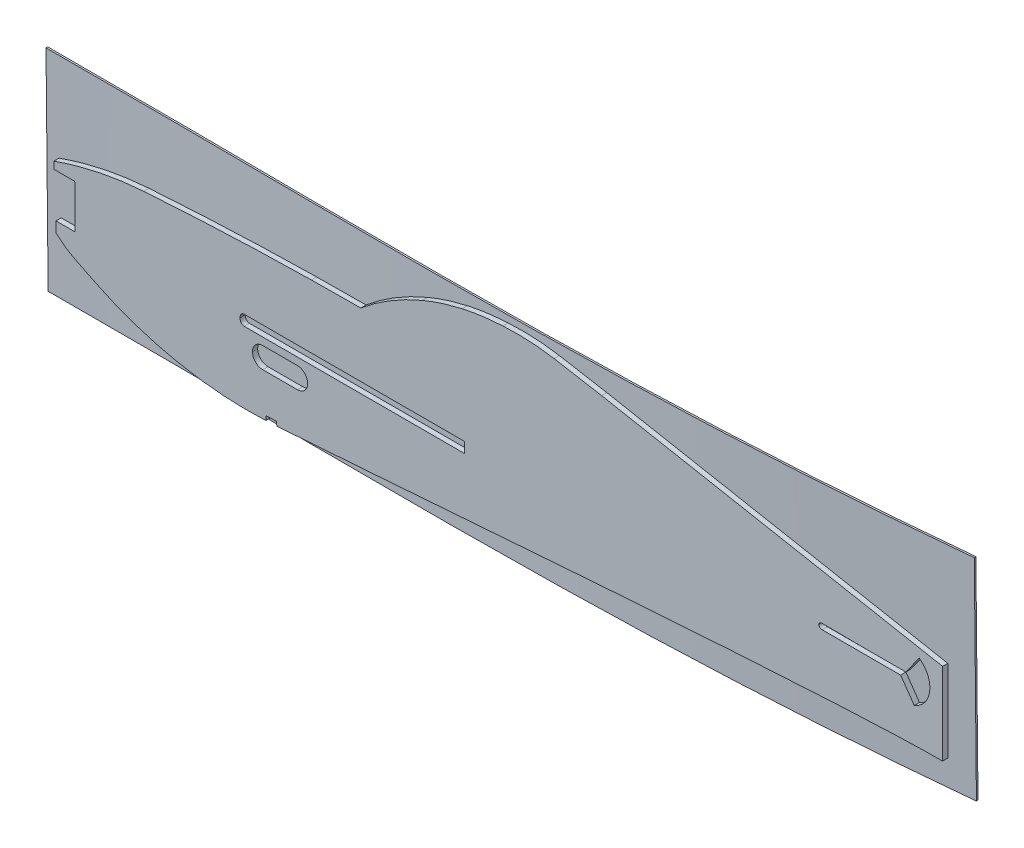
ISO-10303-21;
HEADER;
FILE_DESCRIPTION(('STEP AP214'),'2;1');
FILE_NAME('part.step','',(''),(''),'','','');
FILE_SCHEMA(('AUTOMOTIVE_DESIGN { 1 0 10303 214 1 1 1 1 }'));
ENDSEC;
DATA;
#1=APPLICATION_CONTEXT('core data for automotive mechanical design processes');
#2=APPLICATION_PROTOCOL_DEFINITION('international standard','automotive_design',2000,#1);
#3=PRODUCT_CONTEXT('',#1,'mechanical');
#4=PRODUCT('Part','Part','',(#3));
#5=PRODUCT_RELATED_PRODUCT_CATEGORY('part','',(#4));
#6=PRODUCT_DEFINITION_FORMATION('','',#4);
#7=PRODUCT_DEFINITION_CONTEXT('part definition',#1,'design');
#8=PRODUCT_DEFINITION('design','',#6,#7);
#9=PRODUCT_DEFINITION_SHAPE('','',#8);
#10=(LENGTH_UNIT() NAMED_UNIT(*) SI_UNIT(.MILLI.,.METRE.));
#11=(NAMED_UNIT(*) PLANE_ANGLE_UNIT() SI_UNIT($,.RADIAN.));
#12=(NAMED_UNIT(*) SI_UNIT($,.STERADIAN.) SOLID_ANGLE_UNIT());
#13=UNCERTAINTY_MEASURE_WITH_UNIT(LENGTH_MEASURE(1.E-05),#10,'distance_accuracy_value','');
#14=(GEOMETRIC_REPRESENTATION_CONTEXT(3) GLOBAL_UNCERTAINTY_ASSIGNED_CONTEXT((#13)) GLOBAL_UNIT_ASSIGNED_CONTEXT((#10,
#11,#12)) REPRESENTATION_CONTEXT('',''));
#15=CARTESIAN_POINT('',(0.,0.,0.));
#16=DIRECTION('',(0.,0.,1.));
#17=DIRECTION('',(1.,0.,0.));
#18=AXIS2_PLACEMENT_3D('',#15,#16,#17);
#19=CARTESIAN_POINT('',(-263.849368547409,60.0017037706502,-1.76165987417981));
#20=CARTESIAN_POINT('',(-181.226743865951,60.0015077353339,-2.21999329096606));
#21=CARTESIAN_POINT('',(-99.5935365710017,60.0015252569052,-0.626182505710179));
#22=CARTESIAN_POINT('',(70.4628858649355,60.0019487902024,-2.04590343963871));
#23=CARTESIAN_POINT('',(158.885856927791,60.0023485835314,-5.05988841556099));
#24=CARTESIAN_POINT('',(255.081471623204,60.0028189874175,-14.7363109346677));
#25=CARTESIAN_POINT('',(-263.854915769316,60.,-2.76164303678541));
#26=CARTESIAN_POINT('',(-181.215443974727,60.,-3.22007024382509));
#27=CARTESIAN_POINT('',(-99.5840435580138,60.,-1.62629546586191));
#28=CARTESIAN_POINT('',(70.4366964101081,60.,-3.04571776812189));
#29=CARTESIAN_POINT('',(158.826035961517,60.,-6.05891484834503));
#30=CARTESIAN_POINT('',(254.981386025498,60.,-15.7312857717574));
#31=B_SPLINE_SURFACE_WITH_KNOTS('',1,3,((#19,#20,#21,#22,#23,#24),(#25,#26,#27,#28,#29,#30)),
.UNSPECIFIED.,.F.,.F.,.F.,(2,2),(4,2,4),(0.,1.),(0.,0.5,1.),.UNSPECIFIED.);
#32=CARTESIAN_POINT('',(255.081471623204,60.0028189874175,-14.7363109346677));
#33=CARTESIAN_POINT('',(254.981386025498,60.,-15.7312857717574));
#34=B_SPLINE_CURVE_WITH_KNOTS('',1,(#32,#33),.UNSPECIFIED.,.F.,.F.,(2,2),(0.,1.),.UNSPECIFIED.);
#35=CARTESIAN_POINT('',(254.981386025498,60.,-15.7312857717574));
#36=VERTEX_POINT('',#35);
#37=CARTESIAN_POINT('',(255.081471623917,60.0028189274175,-14.7363109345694));
#38=VERTEX_POINT('',#37);
#39=EDGE_CURVE('E15',#36,#38,#34,.F.);
#40=CARTESIAN_POINT('',(254.981386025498,60.,-15.7312857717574));
#41=CARTESIAN_POINT('',(158.826035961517,60.,-6.05891484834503));
#42=CARTESIAN_POINT('',(70.4366964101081,60.,-3.04571776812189));
#43=CARTESIAN_POINT('',(-99.5840435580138,60.,-1.62629546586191));
#44=CARTESIAN_POINT('',(-181.215443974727,60.,-3.22007024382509));
#45=CARTESIAN_POINT('',(-263.854915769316,60.,-2.76164303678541));
#46=B_SPLINE_CURVE_WITH_KNOTS('',3,(#40,#41,#42,#43,#44,#45),.UNSPECIFIED.,.F.,.F.,(4,2,4),(0.,
0.5,1.),.UNSPECIFIED.);
#47=CARTESIAN_POINT('',(-263.854915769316,60.,-2.76164303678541));
#48=VERTEX_POINT('',#47);
#49=EDGE_CURVE('E255',#36,#48,#46,.T.);
#50=CARTESIAN_POINT('',(-263.854915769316,60.,-2.76164303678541));
#51=CARTESIAN_POINT('',(-263.849368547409,60.0017037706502,-1.76165987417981));
#52=B_SPLINE_CURVE_WITH_KNOTS('',1,(#50,#51),.UNSPECIFIED.,.F.,.F.,(2,2),(0.,1.),.UNSPECIFIED.);
#53=CARTESIAN_POINT('',(-263.84936829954,60.0017037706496,-1.76165987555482));
#54=VERTEX_POINT('',#53);
#55=EDGE_CURVE('E119',#48,#54,#52,.T.);
#56=CARTESIAN_POINT('',(255.081471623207,60.0028189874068,-14.7363109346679));
#57=CARTESIAN_POINT('',(243.18407212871,60.0027608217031,-13.5391631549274));
#58=CARTESIAN_POINT('',(231.277731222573,60.0027030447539,-12.431800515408));
#59=CARTESIAN_POINT('',(207.690564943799,60.0025901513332,-10.4116709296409));
#60=CARTESIAN_POINT('',(196.01003748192,60.0025350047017,-9.49542789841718));
#61=CARTESIAN_POINT('',(172.857504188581,60.0024278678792,-7.84048668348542));
#62=CARTESIAN_POINT('',(161.385713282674,60.0023758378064,-7.09877030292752));
#63=CARTESIAN_POINT('',(138.633628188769,60.0022754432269,-5.77527539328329));
#64=CARTESIAN_POINT('',(127.353482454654,60.0022270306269,-5.19093380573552));
#65=CARTESIAN_POINT('',(104.96764695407,60.0021343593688,-4.16474394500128));
#66=CARTESIAN_POINT('',(93.8620541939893,60.002090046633,-3.72076498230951));
#67=CARTESIAN_POINT('',(71.8082648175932,60.002006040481,-2.95783983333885));
#68=CARTESIAN_POINT('',(60.8601272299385,60.0019662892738,-2.63716972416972));
#69=CARTESIAN_POINT('',(39.1041718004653,60.0018918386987,-2.10344203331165));
#70=CARTESIAN_POINT('',(28.2963865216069,60.0018570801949,-1.88903523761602));
#71=CARTESIAN_POINT('',(6.80404297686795,60.0017930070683,-1.55044169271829));
#72=CARTESIAN_POINT('',(-3.88049978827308,60.0017636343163,-1.42524354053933));
#73=CARTESIAN_POINT('',(-25.1434616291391,60.0017106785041,-1.24773308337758));
#74=CARTESIAN_POINT('',(-35.7218750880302,60.0016870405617,-1.19470548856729));
#75=CARTESIAN_POINT('',(-56.7897045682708,60.0016458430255,-1.14418399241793));
#76=CARTESIAN_POINT('',(-67.2791196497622,60.0016282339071,-1.14622605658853));
#77=CARTESIAN_POINT('',(-98.5489847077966,60.0015850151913,-1.20986236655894));
#78=CARTESIAN_POINT('',(-119.329253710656,60.0015685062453,-1.32791794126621));
#79=CARTESIAN_POINT('',(-160.739419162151,60.0015621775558,-1.58039210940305));
#80=CARTESIAN_POINT('',(-181.36931617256,60.0015721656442,-1.71468618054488));
#81=CARTESIAN_POINT('',(-222.615819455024,60.0016183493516,-1.86274682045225));
#82=CARTESIAN_POINT('',(-243.232425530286,60.0016545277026,-1.87659272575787));
#83=CARTESIAN_POINT('',(-263.849368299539,60.0017037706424,-1.76165987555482));
#84=B_SPLINE_CURVE_WITH_KNOTS('',3,(#56,#57,#58,#59,#60,#61,#62,#63,#64,#65,#66,#67,#68,#69,#70,
#71,#72,#73,#74,#75,#76,#77,#78,#79,#80,#81,#82,#83),.UNSPECIFIED.,.F.,.F.,(4,2,2,2,2,2,2,2,2,2,
2,2,2,4),(0.,35.8719564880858,71.019993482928,105.506217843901,139.391172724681,
172.733862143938,205.591805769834,238.021124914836,270.076659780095,301.812116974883,
333.280245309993,395.621917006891,457.512697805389,519.362709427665),.UNSPECIFIED.);
#85=EDGE_CURVE('E169',#38,#54,#84,.T.);
#86=ORIENTED_EDGE('',*,*,#39,.F.);
#87=ORIENTED_EDGE('',*,*,#49,.T.);
#88=ORIENTED_EDGE('',*,*,#55,.T.);
#89=ORIENTED_EDGE('',*,*,#85,.F.);
#90=EDGE_LOOP('',(#86,#87,#88,#89));
#91=FACE_BOUND('',#90,.T.);
#92=ADVANCED_FACE('F107',(#91),#31,.F.);
#93=CARTESIAN_POINT('',(-263.854915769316,60.,-2.76164303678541));
#94=DIRECTION('',(0.999914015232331,0.011873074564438,-0.00556706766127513));
#95=DIRECTION('',(-0.0118823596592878,0.999928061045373,-0.0016377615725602));
#96=AXIS2_PLACEMENT_3D('',#93,#94,#95);
#97=PLANE('',#96);
#98=ORIENTED_EDGE('',*,*,#55,.F.);
#99=DIRECTION('',(0.0118823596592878,-0.999928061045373,0.0016377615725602));
#100=VECTOR('',#99,1.);
#101=CARTESIAN_POINT('',(-263.141922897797,0.,-2.66337027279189));
#102=LINE('',#101,#100);
#103=CARTESIAN_POINT('',(-262.428930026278,-60.,-2.56509750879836));
#104=VERTEX_POINT('',#103);
#105=EDGE_CURVE('E154',#48,#104,#102,.T.);
#106=ORIENTED_EDGE('',*,*,#105,.T.);
#107=CARTESIAN_POINT('',(-262.423382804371,-59.9982962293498,-1.56511434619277));
#108=CARTESIAN_POINT('',(-262.428930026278,-60.,-2.56509750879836));
#109=B_SPLINE_CURVE_WITH_KNOTS('',1,(#107,#108),.UNSPECIFIED.,.F.,.F.,(2,2),(0.,1.),.UNSPECIFIED.);
#110=CARTESIAN_POINT('',(-262.423382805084,-59.9982961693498,-1.56511434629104));
#111=VERTEX_POINT('',#110);
#112=EDGE_CURVE('E149',#104,#111,#109,.F.);
#113=ORIENTED_EDGE('',*,*,#112,.T.);
#114=CARTESIAN_POINT('',(-262.42338280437,-59.9982962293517,-1.56511434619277));
#115=CARTESIAN_POINT('',(-262.482798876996,-54.9982962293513,-1.57330374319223));
#116=CARTESIAN_POINT('',(-262.542214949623,-49.9982962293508,-1.58149314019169));
#117=CARTESIAN_POINT('',(-262.661047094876,-39.9982962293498,-1.59787193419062));
#118=CARTESIAN_POINT('',(-262.720463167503,-34.9982962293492,-1.60606133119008));
#119=CARTESIAN_POINT('',(-262.839295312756,-24.9982962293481,-1.622440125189));
#120=CARTESIAN_POINT('',(-262.898711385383,-19.9982962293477,-1.63062952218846));
#121=CARTESIAN_POINT('',(-263.017543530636,-9.9982962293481,-1.64700831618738));
#122=CARTESIAN_POINT('',(-263.076959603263,-4.99829622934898,-1.65519771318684));
#123=CARTESIAN_POINT('',(-263.195791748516,5.00170377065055,-1.67157650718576));
#124=CARTESIAN_POINT('',(-263.255207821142,10.001703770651,-1.67976590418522));
#125=CARTESIAN_POINT('',(-263.374039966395,20.0017037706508,-1.69614469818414));
#126=CARTESIAN_POINT('',(-263.433456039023,25.0017037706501,-1.70433409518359));
#127=CARTESIAN_POINT('',(-263.552288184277,35.0017037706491,-1.72071288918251));
#128=CARTESIAN_POINT('',(-263.611704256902,40.0017037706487,-1.72890228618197));
#129=CARTESIAN_POINT('',(-263.730536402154,50.0017037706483,-1.7452810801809));
#130=CARTESIAN_POINT('',(-263.789952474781,55.0017037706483,-1.75347047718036));
#131=CARTESIAN_POINT('',(-263.849368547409,60.0017037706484,-1.76165987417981));
#132=B_SPLINE_CURVE_WITH_KNOTS('',3,(#114,#115,#116,#117,#118,#119,#120,#121,#122,#123,#124,
#125,#126,#127,#128,#129,#130,#131),.UNSPECIFIED.,.F.,.F.,(4,2,2,2,2,2,2,2,4),(0.,
15.0010791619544,30.0021583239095,45.003237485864,60.0043166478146,75.005395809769,
90.0064749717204,105.007554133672,120.008633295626),.UNSPECIFIED.);
#133=EDGE_CURVE('E153',#54,#111,#132,.F.);
#134=ORIENTED_EDGE('',*,*,#133,.F.);
#135=EDGE_LOOP('',(#98,#106,#113,#134));
#136=FACE_BOUND('',#135,.T.);
#137=ADVANCED_FACE('F152',(#136),#97,.F.);
#138=CARTESIAN_POINT('',(-262.423382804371,-59.9982962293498,-1.56511434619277));
#139=CARTESIAN_POINT('',(-179.800758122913,-59.9984922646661,-2.02344776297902));
#140=CARTESIAN_POINT('',(-98.1675508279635,-59.9984747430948,-0.429636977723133));
#141=CARTESIAN_POINT('',(71.8888716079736,-59.9980512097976,-1.84935791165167));
#142=CARTESIAN_POINT('',(160.31184267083,-59.9976514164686,-4.86334288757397));
#143=CARTESIAN_POINT('',(256.507457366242,-59.9971810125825,-14.5397654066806));
#144=CARTESIAN_POINT('',(-262.428930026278,-60.,-2.56509750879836));
#145=CARTESIAN_POINT('',(-179.789458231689,-60.,-3.02352471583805));
#146=CARTESIAN_POINT('',(-98.1580578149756,-60.,-1.42974993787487));
#147=CARTESIAN_POINT('',(71.8626821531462,-60.,-2.84917224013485));
#148=CARTESIAN_POINT('',(160.252021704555,-60.,-5.862369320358));
#149=CARTESIAN_POINT('',(256.407371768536,-60.,-15.5347402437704));
#150=B_SPLINE_SURFACE_WITH_KNOTS('',1,3,((#138,#139,#140,#141,#142,#143),(#144,#145,#146,#147,
#148,#149)),.UNSPECIFIED.,.F.,.F.,.F.,(2,2),(4,2,4),(0.,1.),(0.,0.5,1.),.UNSPECIFIED.);
#151=CARTESIAN_POINT('',(-262.428930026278,-60.,-2.56509750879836));
#152=CARTESIAN_POINT('',(-179.789458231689,-60.,-3.02352471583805));
#153=CARTESIAN_POINT('',(-98.1580578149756,-60.,-1.42974993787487));
#154=CARTESIAN_POINT('',(71.8626821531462,-60.,-2.84917224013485));
#155=CARTESIAN_POINT('',(160.252021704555,-60.,-5.862369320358));
#156=CARTESIAN_POINT('',(256.407371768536,-60.,-15.5347402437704));
#157=B_SPLINE_CURVE_WITH_KNOTS('',3,(#151,#152,#153,#154,#155,#156),.UNSPECIFIED.,.F.,.F.,(4,2,
4),(0.,0.5,1.),.UNSPECIFIED.);
#158=CARTESIAN_POINT('',(256.407371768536,-60.,-15.5347402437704));
#159=VERTEX_POINT('',#158);
#160=EDGE_CURVE('E171',#104,#159,#157,.T.);
#161=CARTESIAN_POINT('',(256.407371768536,-60.,-15.5347402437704));
#162=CARTESIAN_POINT('',(256.507457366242,-59.9971810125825,-14.5397654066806));
#163=B_SPLINE_CURVE_WITH_KNOTS('',1,(#161,#162),.UNSPECIFIED.,.F.,.F.,(2,2),(0.,1.),.UNSPECIFIED.);
#164=CARTESIAN_POINT('',(256.507457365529,-59.9971809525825,-14.5397654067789));
#165=VERTEX_POINT('',#164);
#166=EDGE_CURVE('E160',#159,#165,#163,.T.);
#167=CARTESIAN_POINT('',(-262.42338280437,-59.9982962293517,-1.56511434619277));
#168=CARTESIAN_POINT('',(-241.806440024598,-59.9983454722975,-1.68004719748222));
#169=CARTESIAN_POINT('',(-221.189833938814,-59.9983816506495,-1.66620129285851));
#170=CARTESIAN_POINT('',(-179.943330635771,-59.9984278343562,-1.51814065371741));
#171=CARTESIAN_POINT('',(-159.313433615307,-59.998437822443,-1.38384658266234));
#172=CARTESIAN_POINT('',(-117.903268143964,-59.9984314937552,-1.13137241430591));
#173=CARTESIAN_POINT('',(-97.1229991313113,-59.9984149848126,-1.01331683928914));
#174=CARTESIAN_POINT('',(-65.8531340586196,-59.9983717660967,-0.94968052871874));
#175=CARTESIAN_POINT('',(-55.3637189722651,-59.9983541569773,-0.947638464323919));
#176=CARTESIAN_POINT('',(-34.2958894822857,-59.9983129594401,-0.998159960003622));
#177=CARTESIAN_POINT('',(-23.717476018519,-59.9982893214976,-1.05118755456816));
#178=CARTESIAN_POINT('',(-2.45451416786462,-59.9982363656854,-1.22869801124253));
#179=CARTESIAN_POINT('',(8.23002860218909,-59.9982069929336,-1.35389616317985));
#180=CARTESIAN_POINT('',(29.7223721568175,-59.9981429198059,-1.69248970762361));
#181=CARTESIAN_POINT('',(40.5301574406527,-59.9981081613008,-1.90689650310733));
#182=CARTESIAN_POINT('',(62.2861128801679,-59.9980337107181,-2.44062419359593));
#183=CARTESIAN_POINT('',(73.2342504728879,-59.9979939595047,-2.76129430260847));
#184=CARTESIAN_POINT('',(95.28803985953,-59.9979099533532,-3.52421945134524));
#185=CARTESIAN_POINT('',(106.393632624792,-59.9978656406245,-3.96819841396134));
#186=CARTESIAN_POINT('',(128.779468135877,-59.9977729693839,-4.99438827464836));
#187=CARTESIAN_POINT('',(140.059613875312,-59.9977245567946,-5.57872986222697));
#188=CARTESIAN_POINT('',(162.811698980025,-59.9976241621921,-6.90222477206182));
#189=CARTESIAN_POINT('',(174.283489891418,-59.997572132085,-7.6439411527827));
#190=CARTESIAN_POINT('',(197.436023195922,-59.9974649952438,-9.29888236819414));
#191=CARTESIAN_POINT('',(209.11655066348,-59.9974098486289,-10.2151253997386));
#192=CARTESIAN_POINT('',(232.703716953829,-59.997296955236,-12.2352549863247));
#193=CARTESIAN_POINT('',(244.610057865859,-59.997239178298,-13.3426176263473));
#194=CARTESIAN_POINT('',(256.507457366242,-59.9971810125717,-14.5397654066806));
#195=B_SPLINE_CURVE_WITH_KNOTS('',3,(#167,#168,#169,#170,#171,#172,#173,#174,#175,#176,#177,
#178,#179,#180,#181,#182,#183,#184,#185,#186,#187,#188,#189,#190,#191,#192,#193,#194),
.UNSPECIFIED.,.F.,.F.,(4,2,2,2,2,2,2,2,2,2,2,2,2,4),(0.,61.8500116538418,123.740792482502,
186.082464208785,217.550592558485,249.286049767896,281.341584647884,313.7709038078,
346.628847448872,379.971536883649,413.856491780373,448.342716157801,483.490753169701,
519.362709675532),.UNSPECIFIED.);
#196=EDGE_CURVE('E167',#111,#165,#195,.T.);
#197=ORIENTED_EDGE('',*,*,#112,.F.);
#198=ORIENTED_EDGE('',*,*,#160,.T.);
#199=ORIENTED_EDGE('',*,*,#166,.T.);
#200=ORIENTED_EDGE('',*,*,#196,.F.);
#201=EDGE_LOOP('',(#197,#198,#199,#200));
#202=FACE_BOUND('',#201,.T.);
#203=ADVANCED_FACE('F174',(#202),#150,.T.);
#204=CARTESIAN_POINT('',(256.407371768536,-60.,-15.5347402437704));
#205=DIRECTION('',(0.994907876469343,0.0116587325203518,-0.100111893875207));
#206=DIRECTION('',(-0.0118823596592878,0.999928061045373,-0.0016377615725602));
#207=AXIS2_PLACEMENT_3D('',#204,#205,#206);
#208=PLANE('',#207);
#209=DIRECTION('',(-0.0118823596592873,0.999928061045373,-0.00163776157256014));
#210=VECTOR('',#209,1.);
#211=CARTESIAN_POINT('',(255.694378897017,0.,-15.6330130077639));
#212=LINE('',#211,#210);
#213=EDGE_CURVE('E262',#159,#36,#212,.T.);
#214=ORIENTED_EDGE('',*,*,#213,.T.);
#215=ORIENTED_EDGE('',*,*,#39,.T.);
#216=CARTESIAN_POINT('',(256.507457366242,-59.9971810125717,-14.5397654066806));
#217=CARTESIAN_POINT('',(256.448041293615,-54.9971810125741,-14.54795480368));
#218=CARTESIAN_POINT('',(256.388625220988,-49.9971810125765,-14.5561442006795));
#219=CARTESIAN_POINT('',(256.269793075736,-39.9971810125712,-14.5725229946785));
#220=CARTESIAN_POINT('',(256.21037700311,-34.9971810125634,-14.580712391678));
#221=CARTESIAN_POINT('',(256.091544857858,-24.9971810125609,-14.5970911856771));
#222=CARTESIAN_POINT('',(256.032128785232,-19.9971810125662,-14.6052805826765));
#223=CARTESIAN_POINT('',(255.913296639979,-9.99718101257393,-14.6216593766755));
#224=CARTESIAN_POINT('',(255.853880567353,-4.99718101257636,-14.629848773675));
#225=CARTESIAN_POINT('',(255.735048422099,5.00281898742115,-14.6462275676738));
#226=CARTESIAN_POINT('',(255.675632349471,10.0028189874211,-14.6544169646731));
#227=CARTESIAN_POINT('',(255.556800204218,20.0028189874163,-14.6707957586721));
#228=CARTESIAN_POINT('',(255.497384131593,25.0028189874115,-14.6789851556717));
#229=CARTESIAN_POINT('',(255.378551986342,35.0028189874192,-14.6953639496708));
#230=CARTESIAN_POINT('',(255.319135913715,40.0028189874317,-14.7035533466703));
#231=CARTESIAN_POINT('',(255.200303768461,50.0028189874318,-14.7199321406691));
#232=CARTESIAN_POINT('',(255.140887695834,55.0028189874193,-14.7281215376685));
#233=CARTESIAN_POINT('',(255.081471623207,60.0028189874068,-14.7363109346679));
#234=B_SPLINE_CURVE_WITH_KNOTS('',3,(#216,#217,#218,#219,#220,#221,#222,#223,#224,#225,#226,
#227,#228,#229,#230,#231,#232,#233),.UNSPECIFIED.,.F.,.F.,(4,2,2,2,2,2,2,2,4),(0.,
15.0010791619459,30.0021583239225,45.0032374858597,60.0043166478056,75.0053958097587,
90.0064749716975,105.007554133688,120.008633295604),.UNSPECIFIED.);
#235=EDGE_CURVE('E177',#165,#38,#234,.T.);
#236=ORIENTED_EDGE('',*,*,#235,.F.);
#237=ORIENTED_EDGE('',*,*,#166,.F.);
#238=EDGE_LOOP('',(#214,#215,#236,#237));
#239=FACE_BOUND('',#238,.T.);
#240=ADVANCED_FACE('F109',(#239),#208,.T.);
#241=CARTESIAN_POINT('',(-262.428930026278,-60.,-2.56509750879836));
#242=CARTESIAN_POINT('',(-263.854915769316,60.,-2.76164303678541));
#243=CARTESIAN_POINT('',(-97.1499864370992,-60.,-3.48195192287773));
#244=CARTESIAN_POINT('',(-98.5759721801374,60.,-3.67849745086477));
#245=CARTESIAN_POINT('',(64.0966716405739,-60.,3.81000160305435));
#246=CARTESIAN_POINT('',(62.6706858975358,60.,3.61345607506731));
#247=CARTESIAN_POINT('',(256.407371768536,-60.,-15.5347402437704));
#248=CARTESIAN_POINT('',(254.981386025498,60.,-15.7312857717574));
#249=B_SPLINE_SURFACE_WITH_KNOTS('',3,1,((#241,#242),(#243,#244),(#245,#246),(#247,#248)),
.UNSPECIFIED.,.F.,.F.,.F.,(4,4),(2,2),(0.,1.),(0.,1.),.UNSPECIFIED.);
#250=OFFSET_SURFACE('',#249,1.,.F.);
#251=ORIENTED_EDGE('',*,*,#196,.T.);
#252=ORIENTED_EDGE('',*,*,#235,.T.);
#253=ORIENTED_EDGE('',*,*,#85,.T.);
#254=ORIENTED_EDGE('',*,*,#133,.T.);
#255=EDGE_LOOP('',(#251,#252,#253,#254));
#256=FACE_BOUND('',#255,.T.);
#257=ADVANCED_FACE('F165',(#256),#250,.T.);
#258=CARTESIAN_POINT('',(-262.428930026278,-60.,-2.56509750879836));
#259=CARTESIAN_POINT('',(-263.854915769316,60.,-2.76164303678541));
#260=CARTESIAN_POINT('',(-97.1499864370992,-60.,-3.48195192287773));
#261=CARTESIAN_POINT('',(-98.5759721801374,60.,-3.67849745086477));
#262=CARTESIAN_POINT('',(64.0966716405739,-60.,3.81000160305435));
#263=CARTESIAN_POINT('',(62.6706858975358,60.,3.61345607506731));
#264=CARTESIAN_POINT('',(256.407371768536,-60.,-15.5347402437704));
#265=CARTESIAN_POINT('',(254.981386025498,60.,-15.7312857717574));
#266=B_SPLINE_SURFACE_WITH_KNOTS('',3,1,((#258,#259),(#260,#261),(#262,#263),(#264,#265)),
.UNSPECIFIED.,.F.,.F.,.F.,(4,4),(2,2),(0.,1.),(0.,1.),.UNSPECIFIED.);
#267=ORIENTED_EDGE('',*,*,#160,.F.);
#268=ORIENTED_EDGE('',*,*,#105,.F.);
#269=ORIENTED_EDGE('',*,*,#49,.F.);
#270=ORIENTED_EDGE('',*,*,#213,.F.);
#271=EDGE_LOOP('',(#267,#268,#269,#270));
#272=FACE_BOUND('',#271,.T.);
#273=ADVANCED_FACE('F276',(#272),#266,.F.);
#274=CLOSED_SHELL('',(#92,#137,#203,#240,#257,#273));
#275=MANIFOLD_SOLID_BREP('B2',#274);
#276=CARTESIAN_POINT('',(57.5268837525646,-43.1881611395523,3.));
#277=DIRECTION('',(0.,0.,-1.));
#278=DIRECTION('',(-1.,0.,0.));
#279=AXIS2_PLACEMENT_3D('',#276,#277,#278);
#280=PLANE('',#279);
#281=CARTESIAN_POINT('',(-145.596968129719,-10.6193579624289,3.));
#282=CARTESIAN_POINT('',(-146.906341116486,-10.6377534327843,3.));
#283=CARTESIAN_POINT('',(-147.961855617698,-11.9899099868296,3.));
#284=CARTESIAN_POINT('',(-147.93896270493,-13.6194068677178,3.));
#285=B_SPLINE_CURVE_WITH_KNOTS('',3,(#281,#282,#283,#284),.UNSPECIFIED.,.F.,.F.,(4,4),(0.,
0.333333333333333),.UNSPECIFIED.);
#286=CARTESIAN_POINT('',(-145.596968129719,-10.6193579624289,3.));
#287=VERTEX_POINT('',#286);
#288=CARTESIAN_POINT('',(-147.93896270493,-13.6194068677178,3.));
#289=VERTEX_POINT('',#288);
#290=EDGE_CURVE('E803',#287,#289,#285,.T.);
#291=ORIENTED_EDGE('',*,*,#290,.F.);
#292=DIRECTION('',(-1.,0.,0.));
#293=VECTOR('',#292,1.);
#294=CARTESIAN_POINT('',(-145.596968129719,-10.6193579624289,3.));
#295=LINE('',#294,#293);
#296=CARTESIAN_POINT('',(-19.418617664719,-10.6193579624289,3.));
#297=VERTEX_POINT('',#296);
#298=EDGE_CURVE('E814',#297,#287,#295,.T.);
#299=ORIENTED_EDGE('',*,*,#298,.F.);
#300=DIRECTION('',(0.,1.,0.));
#301=VECTOR('',#300,1.);
#302=CARTESIAN_POINT('',(-19.418617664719,-10.6193579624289,3.));
#303=LINE('',#302,#301);
#304=CARTESIAN_POINT('',(-19.418617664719,-16.6193579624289,3.));
#305=VERTEX_POINT('',#304);
#306=EDGE_CURVE('E811',#305,#297,#303,.T.);
#307=ORIENTED_EDGE('',*,*,#306,.F.);
#308=DIRECTION('',(1.,0.,0.));
#309=VECTOR('',#308,1.);
#310=CARTESIAN_POINT('',(-105.606007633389,-16.6193579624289,3.));
#311=LINE('',#310,#309);
#312=CARTESIAN_POINT('',(-145.596968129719,-16.6193579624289,3.));
#313=VERTEX_POINT('',#312);
#314=EDGE_CURVE('E802',#313,#305,#311,.T.);
#315=ORIENTED_EDGE('',*,*,#314,.F.);
#316=CARTESIAN_POINT('',(-147.93896270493,-13.6194068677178,3.));
#317=CARTESIAN_POINT('',(-147.961856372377,-15.248903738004,3.));
#318=CARTESIAN_POINT('',(-146.906341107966,-16.6009618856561,3.));
#319=CARTESIAN_POINT('',(-145.596968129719,-16.6193579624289,3.));
#320=B_SPLINE_CURVE_WITH_KNOTS('',3,(#316,#317,#318,#319),.UNSPECIFIED.,.F.,.F.,(4,4),
(0.333333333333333,0.666666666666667),.UNSPECIFIED.);
#321=EDGE_CURVE('E797',#289,#313,#320,.T.);
#322=ORIENTED_EDGE('',*,*,#321,.F.);
#323=EDGE_LOOP('',(#291,#299,#307,#315,#322));
#324=FACE_BOUND('',#323,.T.);
#325=CARTESIAN_POINT('',(-126.794534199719,-56.8182384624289,3.));
#326=CARTESIAN_POINT('',(-68.3661576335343,-53.1870296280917,3.));
#327=CARTESIAN_POINT('',(179.163302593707,-32.2814904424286,3.));
#328=CARTESIAN_POINT('',(254.618169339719,-32.2814904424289,3.));
#329=B_SPLINE_CURVE_WITH_KNOTS('',3,(#325,#326,#327,#328),.UNSPECIFIED.,.F.,.F.,(4,4),(0.,
0.620923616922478),.UNSPECIFIED.);
#330=CARTESIAN_POINT('',(-126.794534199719,-56.8182384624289,3.));
#331=VERTEX_POINT('',#330);
#332=CARTESIAN_POINT('',(254.618169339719,-32.2814904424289,3.));
#333=VERTEX_POINT('',#332);
#334=EDGE_CURVE('E1017',#331,#333,#329,.T.);
#335=ORIENTED_EDGE('',*,*,#334,.T.);
#336=DIRECTION('',(0.,1.,0.));
#337=VECTOR('',#336,1.);
#338=CARTESIAN_POINT('',(254.618169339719,-32.2814904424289,3.));
#339=LINE('',#338,#337);
#340=CARTESIAN_POINT('',(254.618169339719,14.7185095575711,3.));
#341=VERTEX_POINT('',#340);
#342=EDGE_CURVE('E1132',#333,#341,#339,.T.);
#343=ORIENTED_EDGE('',*,*,#342,.T.);
#344=DIRECTION('',(-0.982850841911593,0.184402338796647,0.));
#345=VECTOR('',#344,1.);
#346=CARTESIAN_POINT('',(59.272731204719,51.3691935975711,3.));
#347=LINE('',#346,#345);
#348=CARTESIAN_POINT('',(59.272731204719,51.3691935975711,3.));
#349=VERTEX_POINT('',#348);
#350=EDGE_CURVE('E1080',#341,#349,#347,.T.);
#351=ORIENTED_EDGE('',*,*,#350,.T.);
#352=DIRECTION('',(-0.984868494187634,0.173303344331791,0.));
#353=VECTOR('',#352,1.);
#354=CARTESIAN_POINT('',(59.272731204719,51.3691935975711,3.));
#355=LINE('',#354,#353);
#356=CARTESIAN_POINT('',(32.019696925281,56.1648003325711,3.));
#357=VERTEX_POINT('',#356);
#358=EDGE_CURVE('E1100',#349,#357,#355,.T.);
#359=ORIENTED_EDGE('',*,*,#358,.T.);
#360=CARTESIAN_POINT('',(32.019696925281,56.1648003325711,3.));
#361=CARTESIAN_POINT('',(22.349853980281,57.8100850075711,3.));
#362=CARTESIAN_POINT('',(12.512070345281,58.2129250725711,3.));
#363=CARTESIAN_POINT('',(2.74144320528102,57.6757720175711,3.));
#364=B_SPLINE_CURVE_WITH_KNOTS('',3,(#360,#361,#362,#363),.UNSPECIFIED.,.F.,.F.,(4,4),(0.75,1.),.UNSPECIFIED.);
#365=CARTESIAN_POINT('',(2.74144320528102,57.6757720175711,3.));
#366=VERTEX_POINT('',#365);
#367=EDGE_CURVE('E1096',#357,#366,#364,.T.);
#368=ORIENTED_EDGE('',*,*,#367,.T.);
#369=CARTESIAN_POINT('',(2.74144320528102,57.6757720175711,3.));
#370=CARTESIAN_POINT('',(-5.11527327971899,57.2728330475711,3.));
#371=CARTESIAN_POINT('',(-12.938460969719,56.2320557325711,3.));
#372=CARTESIAN_POINT('',(-20.593806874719,54.5532422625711,3.));
#373=B_SPLINE_CURVE_WITH_KNOTS('',3,(#369,#370,#371,#372),.UNSPECIFIED.,.F.,.F.,(4,4),(0.5,
0.75),.UNSPECIFIED.);
#374=CARTESIAN_POINT('',(-20.593806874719,54.5532422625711,3.));
#375=VERTEX_POINT('',#374);
#376=EDGE_CURVE('E1099',#366,#375,#373,.T.);
#377=ORIENTED_EDGE('',*,*,#376,.T.);
#378=CARTESIAN_POINT('',(-20.593806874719,54.5532422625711,3.));
#379=CARTESIAN_POINT('',(-28.383366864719,52.8072722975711,3.));
#380=CARTESIAN_POINT('',(-36.005183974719,50.3898362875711,3.));
#381=CARTESIAN_POINT('',(-43.391804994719,47.3008353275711,3.));
#382=B_SPLINE_CURVE_WITH_KNOTS('',3,(#378,#379,#380,#381),.UNSPECIFIED.,.F.,.F.,(4,4),(0.25,
0.5),.UNSPECIFIED.);
#383=CARTESIAN_POINT('',(-43.391804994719,47.3008353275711,3.));
#384=VERTEX_POINT('',#383);
#385=EDGE_CURVE('E1102',#375,#384,#382,.T.);
#386=ORIENTED_EDGE('',*,*,#385,.T.);
#387=CARTESIAN_POINT('',(-43.391804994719,47.3008353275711,3.));
#388=CARTESIAN_POINT('',(-56.150747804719,41.9957689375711,3.));
#389=CARTESIAN_POINT('',(-68.103713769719,34.7433620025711,3.));
#390=CARTESIAN_POINT('',(-78.713846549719,25.8792980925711,3.));
#391=B_SPLINE_CURVE_WITH_KNOTS('',3,(#387,#388,#389,#390),.UNSPECIFIED.,.F.,.F.,(4,4),(0.,0.25),.UNSPECIFIED.);
#392=CARTESIAN_POINT('',(-78.713846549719,25.8792980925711,3.));
#393=VERTEX_POINT('',#392);
#394=EDGE_CURVE('E1205',#384,#393,#391,.T.);
#395=ORIENTED_EDGE('',*,*,#394,.T.);
#396=CARTESIAN_POINT('',(-78.713846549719,25.8792980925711,3.));
#397=CARTESIAN_POINT('',(-88.125052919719,25.8716824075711,3.));
#398=CARTESIAN_POINT('',(-97.537940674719,25.7911737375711,3.));
#399=CARTESIAN_POINT('',(-106.951125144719,25.6386622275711,3.));
#400=B_SPLINE_CURVE_WITH_KNOTS('',3,(#396,#397,#398,#399),.UNSPECIFIED.,.F.,.F.,(4,4),(0.,1.),.UNSPECIFIED.);
#401=CARTESIAN_POINT('',(-106.951125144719,25.6386622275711,3.));
#402=VERTEX_POINT('',#401);
#403=EDGE_CURVE('E1201',#393,#402,#400,.T.);
#404=ORIENTED_EDGE('',*,*,#403,.T.);
#405=CARTESIAN_POINT('',(-106.951125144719,25.6386622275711,3.));
#406=CARTESIAN_POINT('',(-155.066416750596,24.8557706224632,3.));
#407=CARTESIAN_POINT('',(-203.079070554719,21.5816780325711,3.));
#408=B_SPLINE_CURVE_WITH_KNOTS('',2,(#405,#406,#407),.UNSPECIFIED.,.F.,.F.,(3,3),(0.,1.),.UNSPECIFIED.);
#409=CARTESIAN_POINT('',(-203.079070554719,21.5816780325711,3.));
#410=VERTEX_POINT('',#409);
#411=EDGE_CURVE('E1192',#402,#410,#408,.T.);
#412=ORIENTED_EDGE('',*,*,#411,.T.);
#413=CARTESIAN_POINT('',(-203.079070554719,21.5816780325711,3.));
#414=CARTESIAN_POINT('',(-220.672885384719,20.4064888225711,3.));
#415=CARTESIAN_POINT('',(-238.031701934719,16.7130794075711,3.));
#416=CARTESIAN_POINT('',(-254.618169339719,10.7701746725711,3.));
#417=B_SPLINE_CURVE_WITH_KNOTS('',3,(#413,#414,#415,#416),.UNSPECIFIED.,.F.,.F.,(4,4),(0.,1.),.UNSPECIFIED.);
#418=CARTESIAN_POINT('',(-254.618169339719,10.7701746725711,3.));
#419=VERTEX_POINT('',#418);
#420=EDGE_CURVE('E1187',#410,#419,#417,.T.);
#421=ORIENTED_EDGE('',*,*,#420,.T.);
#422=DIRECTION('',(0.,-1.,0.));
#423=VECTOR('',#422,1.);
#424=CARTESIAN_POINT('',(-254.618169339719,10.7701746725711,3.));
#425=LINE('',#424,#423);
#426=CARTESIAN_POINT('',(-254.618169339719,6.7701746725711,3.));
#427=VERTEX_POINT('',#426);
#428=EDGE_CURVE('E1183',#419,#427,#425,.T.);
#429=ORIENTED_EDGE('',*,*,#428,.T.);
#430=DIRECTION('',(0.999999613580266,0.000879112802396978,0.));
#431=VECTOR('',#430,1.);
#432=CARTESIAN_POINT('',(-242.618173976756,6.78072402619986,3.));
#433=LINE('',#432,#431);
#434=CARTESIAN_POINT('',(-242.618173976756,6.78072402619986,3.));
#435=VERTEX_POINT('',#434);
#436=EDGE_CURVE('E1174',#427,#435,#433,.T.);
#437=ORIENTED_EDGE('',*,*,#436,.T.);
#438=DIRECTION('',(0.00945348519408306,-0.99995531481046,0.));
#439=VECTOR('',#438,1.);
#440=CARTESIAN_POINT('',(-242.381836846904,-18.2181588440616,3.));
#441=LINE('',#440,#439);
#442=CARTESIAN_POINT('',(-242.381836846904,-18.2181588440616,3.));
#443=VERTEX_POINT('',#442);
#444=EDGE_CURVE('E1169',#435,#443,#441,.T.);
#445=ORIENTED_EDGE('',*,*,#444,.T.);
#446=DIRECTION('',(-0.999999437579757,-0.00106058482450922,0.));
#447=VECTOR('',#446,1.);
#448=CARTESIAN_POINT('',(-242.381836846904,-18.2181588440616,3.));
#449=LINE('',#448,#447);
#450=CARTESIAN_POINT('',(-253.381830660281,-18.2298252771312,3.));
#451=VERTEX_POINT('',#450);
#452=EDGE_CURVE('E1165',#443,#451,#449,.T.);
#453=ORIENTED_EDGE('',*,*,#452,.T.);
#454=DIRECTION('',(0.,-1.,0.));
#455=VECTOR('',#454,1.);
#456=CARTESIAN_POINT('',(-253.381830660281,-18.2298252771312,3.));
#457=LINE('',#456,#455);
#458=CARTESIAN_POINT('',(-253.381830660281,-24.2298253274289,3.));
#459=VERTEX_POINT('',#458);
#460=EDGE_CURVE('E1156',#451,#459,#457,.T.);
#461=ORIENTED_EDGE('',*,*,#460,.T.);
#462=CARTESIAN_POINT('',(-253.381830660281,-24.2298253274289,3.));
#463=CARTESIAN_POINT('',(-245.488592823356,-31.0692970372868,3.));
#464=CARTESIAN_POINT('',(-244.348347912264,-30.6259789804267,3.));
#465=CARTESIAN_POINT('',(-231.887327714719,-37.0418869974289,3.));
#466=B_SPLINE_CURVE_WITH_KNOTS('',3,(#462,#463,#464,#465),.UNSPECIFIED.,.F.,.F.,(4,4),(0.,1.),.UNSPECIFIED.);
#467=CARTESIAN_POINT('',(-231.887327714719,-37.0418869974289,3.));
#468=VERTEX_POINT('',#467);
#469=EDGE_CURVE('E909',#459,#468,#466,.T.);
#470=ORIENTED_EDGE('',*,*,#469,.T.);
#471=CARTESIAN_POINT('',(-231.887327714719,-37.0418869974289,3.));
#472=CARTESIAN_POINT('',(-201.142913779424,-52.2592298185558,3.));
#473=CARTESIAN_POINT('',(-167.042615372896,-58.8355592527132,3.));
#474=CARTESIAN_POINT('',(-133.140377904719,-57.1874508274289,3.));
#475=B_SPLINE_CURVE_WITH_KNOTS('',3,(#471,#472,#473,#474),.UNSPECIFIED.,.F.,.F.,(4,4),
(0.643257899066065,1.),.UNSPECIFIED.);
#476=CARTESIAN_POINT('',(-133.140377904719,-57.1874508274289,3.));
#477=VERTEX_POINT('',#476);
#478=EDGE_CURVE('E903',#468,#477,#475,.T.);
#479=ORIENTED_EDGE('',*,*,#478,.T.);
#480=DIRECTION('',(0.,1.,0.));
#481=VECTOR('',#480,1.);
#482=CARTESIAN_POINT('',(-133.140377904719,-57.1874508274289,3.));
#483=LINE('',#482,#481);
#484=CARTESIAN_POINT('',(-133.140377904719,-54.8036425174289,3.));
#485=VERTEX_POINT('',#484);
#486=EDGE_CURVE('E908',#477,#485,#483,.T.);
#487=ORIENTED_EDGE('',*,*,#486,.T.);
#488=DIRECTION('',(0.998110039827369,0.0614520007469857,0.));
#489=VECTOR('',#488,1.);
#490=CARTESIAN_POINT('',(-133.140377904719,-54.8036425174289,3.));
#491=LINE('',#490,#489);
#492=CARTESIAN_POINT('',(-127.140377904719,-54.4342323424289,3.));
#493=VERTEX_POINT('',#492);
#494=EDGE_CURVE('E918',#485,#493,#491,.T.);
#495=ORIENTED_EDGE('',*,*,#494,.T.);
#496=DIRECTION('',(0.143565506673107,-0.989640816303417,0.));
#497=VECTOR('',#496,1.);
#498=CARTESIAN_POINT('',(-126.794534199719,-56.8182384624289,3.));
#499=LINE('',#498,#497);
#500=EDGE_CURVE('E920',#493,#331,#499,.T.);
#501=ORIENTED_EDGE('',*,*,#500,.T.);
#502=EDGE_LOOP('',(#335,#343,#351,#359,#368,#377,#386,#395,#404,#412,#421,#429,#437,#445,#453,
#461,#470,#479,#487,#495,#501));
#503=FACE_BOUND('',#502,.T.);
#504=CARTESIAN_POINT('',(-134.886347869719,-20.8405678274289,3.));
#505=CARTESIAN_POINT('',(-138.176742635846,-20.8628844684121,3.));
#506=CARTESIAN_POINT('',(-140.810898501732,-23.5668740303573,3.));
#507=CARTESIAN_POINT('',(-140.788581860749,-26.857268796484,3.));
#508=B_SPLINE_CURVE_WITH_KNOTS('',3,(#504,#505,#506,#507),.UNSPECIFIED.,.F.,.F.,(4,4),(0.5,
0.75),.UNSPECIFIED.);
#509=CARTESIAN_POINT('',(-134.886347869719,-20.8405678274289,3.));
#510=VERTEX_POINT('',#509);
#511=CARTESIAN_POINT('',(-140.788581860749,-26.857268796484,3.));
#512=VERTEX_POINT('',#511);
#513=EDGE_CURVE('E854',#510,#512,#508,.T.);
#514=ORIENTED_EDGE('',*,*,#513,.F.);
#515=DIRECTION('',(-1.,0.,0.));
#516=VECTOR('',#515,1.);
#517=CARTESIAN_POINT('',(-115.042938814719,-20.8405678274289,3.));
#518=LINE('',#517,#516);
#519=CARTESIAN_POINT('',(-115.042938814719,-20.8405678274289,3.));
#520=VERTEX_POINT('',#519);
#521=EDGE_CURVE('E1680',#520,#510,#518,.T.);
#522=ORIENTED_EDGE('',*,*,#521,.F.);
#523=CARTESIAN_POINT('',(-109.140704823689,-26.857268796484,3.));
#524=CARTESIAN_POINT('',(-109.118388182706,-23.5668740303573,3.));
#525=CARTESIAN_POINT('',(-111.786170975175,-20.8626563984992,3.));
#526=CARTESIAN_POINT('',(-115.042938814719,-20.8405678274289,3.));
#527=B_SPLINE_CURVE_WITH_KNOTS('',3,(#523,#524,#525,#526),.UNSPECIFIED.,.F.,.F.,(4,4),(0.,0.25),.UNSPECIFIED.);
#528=CARTESIAN_POINT('',(-109.140704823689,-26.857268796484,3.));
#529=VERTEX_POINT('',#528);
#530=EDGE_CURVE('E1674',#529,#520,#527,.T.);
#531=ORIENTED_EDGE('',*,*,#530,.F.);
#532=CARTESIAN_POINT('',(-115.042938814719,-32.8405678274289,3.));
#533=CARTESIAN_POINT('',(-111.786171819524,-32.8183551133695,3.));
#534=CARTESIAN_POINT('',(-109.11849210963,-30.1140357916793,3.));
#535=CARTESIAN_POINT('',(-109.140704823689,-26.857268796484,3.));
#536=B_SPLINE_CURVE_WITH_KNOTS('',3,(#532,#533,#534,#535),.UNSPECIFIED.,.F.,.F.,(4,4),
(0.666666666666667,1.),.UNSPECIFIED.);
#537=CARTESIAN_POINT('',(-115.042938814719,-32.8405678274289,3.));
#538=VERTEX_POINT('',#537);
#539=EDGE_CURVE('E1681',#538,#529,#536,.T.);
#540=ORIENTED_EDGE('',*,*,#539,.F.);
#541=DIRECTION('',(1.,0.,0.));
#542=VECTOR('',#541,1.);
#543=CARTESIAN_POINT('',(-134.886347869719,-32.8405678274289,3.));
#544=LINE('',#543,#542);
#545=CARTESIAN_POINT('',(-134.886347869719,-32.8405678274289,3.));
#546=VERTEX_POINT('',#545);
#547=EDGE_CURVE('E1755',#546,#538,#544,.T.);
#548=ORIENTED_EDGE('',*,*,#547,.F.);
#549=CARTESIAN_POINT('',(-140.788581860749,-26.857268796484,3.));
#550=CARTESIAN_POINT('',(-140.810794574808,-30.1140357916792,3.));
#551=CARTESIAN_POINT('',(-138.176741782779,-32.8181257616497,3.));
#552=CARTESIAN_POINT('',(-134.886347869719,-32.8405678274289,3.));
#553=B_SPLINE_CURVE_WITH_KNOTS('',3,(#549,#550,#551,#552),.UNSPECIFIED.,.F.,.F.,(4,4),(0.,
0.333333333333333),.UNSPECIFIED.);
#554=EDGE_CURVE('E859',#512,#546,#553,.T.);
#555=ORIENTED_EDGE('',*,*,#554,.F.);
#556=EDGE_LOOP('',(#514,#522,#531,#540,#548,#555));
#557=FACE_BOUND('',#556,.T.);
#558=CARTESIAN_POINT('',(185.562588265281,1.57042719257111,3.));
#559=CARTESIAN_POINT('',(184.488183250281,1.5367994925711,3.));
#560=CARTESIAN_POINT('',(183.648776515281,0.798078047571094,3.));
#561=CARTESIAN_POINT('',(183.682305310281,-0.0748574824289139,3.));
#562=B_SPLINE_CURVE_WITH_KNOTS('',3,(#558,#559,#560,#561),.UNSPECIFIED.,.F.,.F.,(4,4),(0.,0.5),.UNSPECIFIED.);
#563=CARTESIAN_POINT('',(185.562588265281,1.57042719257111,3.));
#564=VERTEX_POINT('',#563);
#565=CARTESIAN_POINT('',(183.682305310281,-0.0748574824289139,3.));
#566=VERTEX_POINT('',#565);
#567=EDGE_CURVE('E734',#564,#566,#562,.T.);
#568=ORIENTED_EDGE('',*,*,#567,.F.);
#569=DIRECTION('',(-0.999966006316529,0.00824537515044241,0.));
#570=VECTOR('',#569,1.);
#571=CARTESIAN_POINT('',(185.562588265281,1.57042719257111,3.));
#572=LINE('',#571,#570);
#573=CARTESIAN_POINT('',(208.578970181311,1.3806420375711,3.));
#574=VERTEX_POINT('',#573);
#575=EDGE_CURVE('E1585',#574,#564,#572,.T.);
#576=ORIENTED_EDGE('',*,*,#575,.F.);
#577=DIRECTION('',(-1.,0.,0.));
#578=VECTOR('',#577,1.);
#579=CARTESIAN_POINT('',(208.578970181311,1.3806420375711,3.));
#580=LINE('',#579,#578);
#581=CARTESIAN_POINT('',(233.562213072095,1.3806420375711,3.));
#582=VERTEX_POINT('',#581);
#583=EDGE_CURVE('E1583',#582,#574,#580,.T.);
#584=ORIENTED_EDGE('',*,*,#583,.F.);
#585=DIRECTION('',(-0.581658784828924,-0.813432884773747,0.));
#586=VECTOR('',#585,1.);
#587=CARTESIAN_POINT('',(233.562213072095,1.3806420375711,3.));
#588=LINE('',#587,#586);
#589=CARTESIAN_POINT('',(241.254800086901,12.1385011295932,3.));
#590=VERTEX_POINT('',#589);
#591=EDGE_CURVE('E1574',#590,#582,#588,.T.);
#592=ORIENTED_EDGE('',*,*,#591,.F.);
#593=CARTESIAN_POINT('',(247.365645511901,0.454062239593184,3.));
#594=CARTESIAN_POINT('',(247.365645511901,5.08756367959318,3.));
#595=CARTESIAN_POINT('',(245.082522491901,9.45243913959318,3.));
#596=CARTESIAN_POINT('',(241.254800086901,12.1385011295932,3.));
#597=B_SPLINE_CURVE_WITH_KNOTS('',3,(#593,#594,#595,#596),.UNSPECIFIED.,.F.,.F.,(4,4),(0.,1.),.UNSPECIFIED.);
#598=CARTESIAN_POINT('',(247.365645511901,0.454062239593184,3.));
#599=VERTEX_POINT('',#598);
#600=EDGE_CURVE('E1569',#599,#590,#597,.T.);
#601=ORIENTED_EDGE('',*,*,#600,.F.);
#602=CARTESIAN_POINT('',(238.434326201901,-12.8084059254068,3.));
#603=CARTESIAN_POINT('',(243.840077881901,-10.6259681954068,3.));
#604=CARTESIAN_POINT('',(247.365645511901,-5.38815720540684,3.));
#605=CARTESIAN_POINT('',(247.365645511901,0.454062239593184,3.));
#606=B_SPLINE_CURVE_WITH_KNOTS('',3,(#602,#603,#604,#605),.UNSPECIFIED.,.F.,.F.,(4,4),(0.,1.),.UNSPECIFIED.);
#607=CARTESIAN_POINT('',(238.434326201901,-12.8084059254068,3.));
#608=VERTEX_POINT('',#607);
#609=EDGE_CURVE('E1575',#608,#599,#606,.T.);
#610=ORIENTED_EDGE('',*,*,#609,.F.);
#611=DIRECTION('',(0.572096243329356,-0.820186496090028,0.));
#612=VECTOR('',#611,1.);
#613=CARTESIAN_POINT('',(230.629744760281,-1.6193579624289,3.));
#614=LINE('',#613,#612);
#615=CARTESIAN_POINT('',(230.629744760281,-1.6193579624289,3.));
#616=VERTEX_POINT('',#615);
#617=EDGE_CURVE('E757',#616,#608,#614,.T.);
#618=ORIENTED_EDGE('',*,*,#617,.F.);
#619=DIRECTION('',(1.,0.,0.));
#620=VECTOR('',#619,1.);
#621=CARTESIAN_POINT('',(230.629744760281,-1.6193579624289,3.));
#622=LINE('',#621,#620);
#623=CARTESIAN_POINT('',(185.629744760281,-1.6193579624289,3.));
#624=VERTEX_POINT('',#623);
#625=EDGE_CURVE('E755',#624,#616,#622,.T.);
#626=ORIENTED_EDGE('',*,*,#625,.F.);
#627=CARTESIAN_POINT('',(183.682305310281,-0.0748574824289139,3.));
#628=CARTESIAN_POINT('',(183.715834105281,-0.914264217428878,3.));
#629=CARTESIAN_POINT('',(184.588868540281,-1.58573026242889,3.));
#630=CARTESIAN_POINT('',(185.629744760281,-1.6193579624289,3.));
#631=B_SPLINE_CURVE_WITH_KNOTS('',3,(#627,#628,#629,#630),.UNSPECIFIED.,.F.,.F.,(4,4),(0.5,1.),.UNSPECIFIED.);
#632=EDGE_CURVE('E742',#566,#624,#631,.T.);
#633=ORIENTED_EDGE('',*,*,#632,.F.);
#634=EDGE_LOOP('',(#568,#576,#584,#592,#601,#610,#618,#626,#633));
#635=FACE_BOUND('',#634,.T.);
#636=ADVANCED_FACE('F470',(#324,#503,#557,#635),#280,.F.);
#637=CARTESIAN_POINT('',(57.5268837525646,-43.1881611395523,0.));
#638=DIRECTION('',(0.,0.,-1.));
#639=DIRECTION('',(-1.,0.,0.));
#640=AXIS2_PLACEMENT_3D('',#637,#638,#639);
#641=PLANE('',#640);
#642=DIRECTION('',(-1.,0.,0.));
#643=VECTOR('',#642,1.);
#644=CARTESIAN_POINT('',(-145.596968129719,-10.6193579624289,0.));
#645=LINE('',#644,#643);
#646=CARTESIAN_POINT('',(-19.418617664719,-10.6193579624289,0.));
#647=VERTEX_POINT('',#646);
#648=CARTESIAN_POINT('',(-145.596968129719,-10.6193579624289,0.));
#649=VERTEX_POINT('',#648);
#650=EDGE_CURVE('E838',#647,#649,#645,.T.);
#651=ORIENTED_EDGE('',*,*,#650,.T.);
#652=CARTESIAN_POINT('',(-145.596968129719,-10.6193579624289,0.));
#653=CARTESIAN_POINT('',(-146.906341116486,-10.6377534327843,0.));
#654=CARTESIAN_POINT('',(-147.961855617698,-11.9899099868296,0.));
#655=CARTESIAN_POINT('',(-147.93896270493,-13.6194068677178,0.));
#656=B_SPLINE_CURVE_WITH_KNOTS('',3,(#652,#653,#654,#655),.UNSPECIFIED.,.F.,.F.,(4,4),(0.,
0.333333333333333),.UNSPECIFIED.);
#657=CARTESIAN_POINT('',(-147.93896270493,-13.6194068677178,0.));
#658=VERTEX_POINT('',#657);
#659=EDGE_CURVE('E750',#649,#658,#656,.T.);
#660=ORIENTED_EDGE('',*,*,#659,.T.);
#661=CARTESIAN_POINT('',(-147.93896270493,-13.6194068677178,0.));
#662=CARTESIAN_POINT('',(-147.961856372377,-15.248903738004,0.));
#663=CARTESIAN_POINT('',(-146.906341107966,-16.6009618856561,0.));
#664=CARTESIAN_POINT('',(-145.596968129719,-16.6193579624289,0.));
#665=B_SPLINE_CURVE_WITH_KNOTS('',3,(#661,#662,#663,#664),.UNSPECIFIED.,.F.,.F.,(4,4),
(0.333333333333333,0.666666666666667),.UNSPECIFIED.);
#666=CARTESIAN_POINT('',(-145.596968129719,-16.6193579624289,0.));
#667=VERTEX_POINT('',#666);
#668=EDGE_CURVE('E821',#658,#667,#665,.T.);
#669=ORIENTED_EDGE('',*,*,#668,.T.);
#670=DIRECTION('',(1.,0.,0.));
#671=VECTOR('',#670,1.);
#672=CARTESIAN_POINT('',(-105.606007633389,-16.6193579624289,0.));
#673=LINE('',#672,#671);
#674=CARTESIAN_POINT('',(-19.418617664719,-16.6193579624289,0.));
#675=VERTEX_POINT('',#674);
#676=EDGE_CURVE('E829',#667,#675,#673,.T.);
#677=ORIENTED_EDGE('',*,*,#676,.T.);
#678=DIRECTION('',(0.,1.,0.));
#679=VECTOR('',#678,1.);
#680=CARTESIAN_POINT('',(-19.418617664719,-10.6193579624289,0.));
#681=LINE('',#680,#679);
#682=EDGE_CURVE('E835',#675,#647,#681,.T.);
#683=ORIENTED_EDGE('',*,*,#682,.T.);
#684=EDGE_LOOP('',(#651,#660,#669,#677,#683));
#685=FACE_BOUND('',#684,.T.);
#686=CARTESIAN_POINT('',(-126.794534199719,-56.8182384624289,0.));
#687=CARTESIAN_POINT('',(-68.3661576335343,-53.1870296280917,0.));
#688=CARTESIAN_POINT('',(179.163302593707,-32.2814904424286,0.));
#689=CARTESIAN_POINT('',(254.618169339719,-32.2814904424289,0.));
#690=B_SPLINE_CURVE_WITH_KNOTS('',3,(#686,#687,#688,#689),.UNSPECIFIED.,.F.,.F.,(4,4),(0.,
0.620923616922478),.UNSPECIFIED.);
#691=CARTESIAN_POINT('',(-126.794534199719,-56.8182384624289,0.));
#692=VERTEX_POINT('',#691);
#693=CARTESIAN_POINT('',(254.618169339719,-32.2814904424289,0.));
#694=VERTEX_POINT('',#693);
#695=EDGE_CURVE('E923',#692,#694,#690,.T.);
#696=ORIENTED_EDGE('',*,*,#695,.F.);
#697=DIRECTION('',(0.143565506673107,-0.989640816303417,0.));
#698=VECTOR('',#697,1.);
#699=CARTESIAN_POINT('',(-126.794534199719,-56.8182384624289,0.));
#700=LINE('',#699,#698);
#701=CARTESIAN_POINT('',(-127.140377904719,-54.4342323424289,0.));
#702=VERTEX_POINT('',#701);
#703=EDGE_CURVE('E1015',#702,#692,#700,.T.);
#704=ORIENTED_EDGE('',*,*,#703,.F.);
#705=DIRECTION('',(0.998110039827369,0.0614520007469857,0.));
#706=VECTOR('',#705,1.);
#707=CARTESIAN_POINT('',(-133.140377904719,-54.8036425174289,0.));
#708=LINE('',#707,#706);
#709=CARTESIAN_POINT('',(-133.140377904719,-54.8036425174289,0.));
#710=VERTEX_POINT('',#709);
#711=EDGE_CURVE('E1013',#710,#702,#708,.T.);
#712=ORIENTED_EDGE('',*,*,#711,.F.);
#713=DIRECTION('',(0.,1.,0.));
#714=VECTOR('',#713,1.);
#715=CARTESIAN_POINT('',(-133.140377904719,-57.1874508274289,0.));
#716=LINE('',#715,#714);
#717=CARTESIAN_POINT('',(-133.140377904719,-57.1874508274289,0.));
#718=VERTEX_POINT('',#717);
#719=EDGE_CURVE('E1008',#718,#710,#716,.T.);
#720=ORIENTED_EDGE('',*,*,#719,.F.);
#721=CARTESIAN_POINT('',(-231.887327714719,-37.0418869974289,0.));
#722=CARTESIAN_POINT('',(-201.142913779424,-52.2592298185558,0.));
#723=CARTESIAN_POINT('',(-167.042615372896,-58.8355592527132,0.));
#724=CARTESIAN_POINT('',(-133.140377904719,-57.1874508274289,0.));
#725=B_SPLINE_CURVE_WITH_KNOTS('',3,(#721,#722,#723,#724),.UNSPECIFIED.,.F.,.F.,(4,4),
(0.643257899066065,1.),.UNSPECIFIED.);
#726=CARTESIAN_POINT('',(-231.887327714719,-37.0418869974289,0.));
#727=VERTEX_POINT('',#726);
#728=EDGE_CURVE('E1001',#727,#718,#725,.T.);
#729=ORIENTED_EDGE('',*,*,#728,.F.);
#730=CARTESIAN_POINT('',(-253.381830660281,-24.2298253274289,0.));
#731=CARTESIAN_POINT('',(-245.488592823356,-31.0692970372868,0.));
#732=CARTESIAN_POINT('',(-244.348347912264,-30.6259789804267,0.));
#733=CARTESIAN_POINT('',(-231.887327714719,-37.0418869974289,0.));
#734=B_SPLINE_CURVE_WITH_KNOTS('',3,(#730,#731,#732,#733),.UNSPECIFIED.,.F.,.F.,(4,4),(0.,1.),.UNSPECIFIED.);
#735=CARTESIAN_POINT('',(-253.381830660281,-24.2298253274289,0.));
#736=VERTEX_POINT('',#735);
#737=EDGE_CURVE('E997',#736,#727,#734,.T.);
#738=ORIENTED_EDGE('',*,*,#737,.F.);
#739=DIRECTION('',(0.,-1.,0.));
#740=VECTOR('',#739,1.);
#741=CARTESIAN_POINT('',(-253.381830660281,-18.2298252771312,0.));
#742=LINE('',#741,#740);
#743=CARTESIAN_POINT('',(-253.381830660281,-18.2298252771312,0.));
#744=VERTEX_POINT('',#743);
#745=EDGE_CURVE('E995',#744,#736,#742,.T.);
#746=ORIENTED_EDGE('',*,*,#745,.F.);
#747=DIRECTION('',(-0.999999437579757,-0.00106058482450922,0.));
#748=VECTOR('',#747,1.);
#749=CARTESIAN_POINT('',(-242.381836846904,-18.2181588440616,0.));
#750=LINE('',#749,#748);
#751=CARTESIAN_POINT('',(-242.381836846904,-18.2181588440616,0.));
#752=VERTEX_POINT('',#751);
#753=EDGE_CURVE('E993',#752,#744,#750,.T.);
#754=ORIENTED_EDGE('',*,*,#753,.F.);
#755=DIRECTION('',(0.00945348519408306,-0.99995531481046,0.));
#756=VECTOR('',#755,1.);
#757=CARTESIAN_POINT('',(-242.381836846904,-18.2181588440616,0.));
#758=LINE('',#757,#756);
#759=CARTESIAN_POINT('',(-242.618173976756,6.78072402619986,0.));
#760=VERTEX_POINT('',#759);
#761=EDGE_CURVE('E991',#760,#752,#758,.T.);
#762=ORIENTED_EDGE('',*,*,#761,.F.);
#763=DIRECTION('',(0.999999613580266,0.000879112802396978,0.));
#764=VECTOR('',#763,1.);
#765=CARTESIAN_POINT('',(-242.618173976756,6.78072402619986,0.));
#766=LINE('',#765,#764);
#767=CARTESIAN_POINT('',(-254.618169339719,6.7701746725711,0.));
#768=VERTEX_POINT('',#767);
#769=EDGE_CURVE('E989',#768,#760,#766,.T.);
#770=ORIENTED_EDGE('',*,*,#769,.F.);
#771=DIRECTION('',(0.,-1.,0.));
#772=VECTOR('',#771,1.);
#773=CARTESIAN_POINT('',(-254.618169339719,10.7701746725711,0.));
#774=LINE('',#773,#772);
#775=CARTESIAN_POINT('',(-254.618169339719,10.7701746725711,0.));
#776=VERTEX_POINT('',#775);
#777=EDGE_CURVE('E984',#776,#768,#774,.T.);
#778=ORIENTED_EDGE('',*,*,#777,.F.);
#779=CARTESIAN_POINT('',(-203.079070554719,21.5816780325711,0.));
#780=CARTESIAN_POINT('',(-220.672885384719,20.4064888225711,0.));
#781=CARTESIAN_POINT('',(-238.031701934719,16.7130794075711,0.));
#782=CARTESIAN_POINT('',(-254.618169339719,10.7701746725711,0.));
#783=B_SPLINE_CURVE_WITH_KNOTS('',3,(#779,#780,#781,#782),.UNSPECIFIED.,.F.,.F.,(4,4),(0.,1.),.UNSPECIFIED.);
#784=CARTESIAN_POINT('',(-203.079070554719,21.5816780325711,0.));
#785=VERTEX_POINT('',#784);
#786=EDGE_CURVE('E977',#785,#776,#783,.T.);
#787=ORIENTED_EDGE('',*,*,#786,.F.);
#788=CARTESIAN_POINT('',(-106.951125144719,25.6386622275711,0.));
#789=CARTESIAN_POINT('',(-155.066416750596,24.8557706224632,0.));
#790=CARTESIAN_POINT('',(-203.079070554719,21.5816780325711,0.));
#791=B_SPLINE_CURVE_WITH_KNOTS('',2,(#788,#789,#790),.UNSPECIFIED.,.F.,.F.,(3,3),(0.,1.),.UNSPECIFIED.);
#792=CARTESIAN_POINT('',(-106.951125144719,25.6386622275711,0.));
#793=VERTEX_POINT('',#792);
#794=EDGE_CURVE('E970',#793,#785,#791,.T.);
#795=ORIENTED_EDGE('',*,*,#794,.F.);
#796=CARTESIAN_POINT('',(-78.713846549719,25.8792980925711,0.));
#797=CARTESIAN_POINT('',(-88.125052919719,25.8716824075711,0.));
#798=CARTESIAN_POINT('',(-97.537940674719,25.7911737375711,0.));
#799=CARTESIAN_POINT('',(-106.951125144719,25.6386622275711,0.));
#800=B_SPLINE_CURVE_WITH_KNOTS('',3,(#796,#797,#798,#799),.UNSPECIFIED.,.F.,.F.,(4,4),(0.,1.),.UNSPECIFIED.);
#801=CARTESIAN_POINT('',(-78.713846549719,25.8792980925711,0.));
#802=VERTEX_POINT('',#801);
#803=EDGE_CURVE('E963',#802,#793,#800,.T.);
#804=ORIENTED_EDGE('',*,*,#803,.F.);
#805=CARTESIAN_POINT('',(-43.391804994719,47.3008353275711,0.));
#806=CARTESIAN_POINT('',(-56.150747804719,41.9957689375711,0.));
#807=CARTESIAN_POINT('',(-68.103713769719,34.7433620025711,0.));
#808=CARTESIAN_POINT('',(-78.713846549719,25.8792980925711,0.));
#809=B_SPLINE_CURVE_WITH_KNOTS('',3,(#805,#806,#807,#808),.UNSPECIFIED.,.F.,.F.,(4,4),(0.,0.25),.UNSPECIFIED.);
#810=CARTESIAN_POINT('',(-43.391804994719,47.3008353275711,0.));
#811=VERTEX_POINT('',#810);
#812=EDGE_CURVE('E956',#811,#802,#809,.T.);
#813=ORIENTED_EDGE('',*,*,#812,.F.);
#814=CARTESIAN_POINT('',(-20.593806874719,54.5532422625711,0.));
#815=CARTESIAN_POINT('',(-28.383366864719,52.8072722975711,0.));
#816=CARTESIAN_POINT('',(-36.005183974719,50.3898362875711,0.));
#817=CARTESIAN_POINT('',(-43.391804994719,47.3008353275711,0.));
#818=B_SPLINE_CURVE_WITH_KNOTS('',3,(#814,#815,#816,#817),.UNSPECIFIED.,.F.,.F.,(4,4),(0.25,
0.5),.UNSPECIFIED.);
#819=CARTESIAN_POINT('',(-20.593806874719,54.5532422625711,0.));
#820=VERTEX_POINT('',#819);
#821=EDGE_CURVE('E949',#820,#811,#818,.T.);
#822=ORIENTED_EDGE('',*,*,#821,.F.);
#823=CARTESIAN_POINT('',(2.74144320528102,57.6757720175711,0.));
#824=CARTESIAN_POINT('',(-5.11527327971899,57.2728330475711,0.));
#825=CARTESIAN_POINT('',(-12.938460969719,56.2320557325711,0.));
#826=CARTESIAN_POINT('',(-20.593806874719,54.5532422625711,0.));
#827=B_SPLINE_CURVE_WITH_KNOTS('',3,(#823,#824,#825,#826),.UNSPECIFIED.,.F.,.F.,(4,4),(0.5,
0.75),.UNSPECIFIED.);
#828=CARTESIAN_POINT('',(2.74144320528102,57.6757720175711,0.));
#829=VERTEX_POINT('',#828);
#830=EDGE_CURVE('E942',#829,#820,#827,.T.);
#831=ORIENTED_EDGE('',*,*,#830,.F.);
#832=CARTESIAN_POINT('',(32.019696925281,56.1648003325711,0.));
#833=CARTESIAN_POINT('',(22.349853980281,57.8100850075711,0.));
#834=CARTESIAN_POINT('',(12.512070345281,58.2129250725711,0.));
#835=CARTESIAN_POINT('',(2.74144320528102,57.6757720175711,0.));
#836=B_SPLINE_CURVE_WITH_KNOTS('',3,(#832,#833,#834,#835),.UNSPECIFIED.,.F.,.F.,(4,4),(0.75,1.),.UNSPECIFIED.);
#837=CARTESIAN_POINT('',(32.019696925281,56.1648003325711,0.));
#838=VERTEX_POINT('',#837);
#839=EDGE_CURVE('E938',#838,#829,#836,.T.);
#840=ORIENTED_EDGE('',*,*,#839,.F.);
#841=DIRECTION('',(-0.984868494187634,0.173303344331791,0.));
#842=VECTOR('',#841,1.);
#843=CARTESIAN_POINT('',(59.272731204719,51.3691935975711,0.));
#844=LINE('',#843,#842);
#845=CARTESIAN_POINT('',(59.272731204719,51.3691935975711,0.));
#846=VERTEX_POINT('',#845);
#847=EDGE_CURVE('E936',#846,#838,#844,.T.);
#848=ORIENTED_EDGE('',*,*,#847,.F.);
#849=DIRECTION('',(-0.982850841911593,0.184402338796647,0.));
#850=VECTOR('',#849,1.);
#851=CARTESIAN_POINT('',(59.272731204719,51.3691935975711,0.));
#852=LINE('',#851,#850);
#853=CARTESIAN_POINT('',(254.618169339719,14.7185095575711,0.));
#854=VERTEX_POINT('',#853);
#855=EDGE_CURVE('E934',#854,#846,#852,.T.);
#856=ORIENTED_EDGE('',*,*,#855,.F.);
#857=DIRECTION('',(0.,1.,0.));
#858=VECTOR('',#857,1.);
#859=CARTESIAN_POINT('',(254.618169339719,-32.2814904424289,0.));
#860=LINE('',#859,#858);
#861=EDGE_CURVE('E928',#694,#854,#860,.T.);
#862=ORIENTED_EDGE('',*,*,#861,.F.);
#863=EDGE_LOOP('',(#696,#704,#712,#720,#729,#738,#746,#754,#762,#770,#778,#787,#795,#804,#813,
#822,#831,#840,#848,#856,#862));
#864=FACE_BOUND('',#863,.T.);
#865=DIRECTION('',(-1.,0.,0.));
#866=VECTOR('',#865,1.);
#867=CARTESIAN_POINT('',(-115.042938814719,-20.8405678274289,0.));
#868=LINE('',#867,#866);
#869=CARTESIAN_POINT('',(-115.042938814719,-20.8405678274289,0.));
#870=VERTEX_POINT('',#869);
#871=CARTESIAN_POINT('',(-134.886347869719,-20.8405678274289,0.));
#872=VERTEX_POINT('',#871);
#873=EDGE_CURVE('E860',#870,#872,#868,.T.);
#874=ORIENTED_EDGE('',*,*,#873,.T.);
#875=CARTESIAN_POINT('',(-134.886347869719,-20.8405678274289,0.));
#876=CARTESIAN_POINT('',(-138.176742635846,-20.8628844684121,0.));
#877=CARTESIAN_POINT('',(-140.810898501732,-23.5668740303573,0.));
#878=CARTESIAN_POINT('',(-140.788581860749,-26.857268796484,0.));
#879=B_SPLINE_CURVE_WITH_KNOTS('',3,(#875,#876,#877,#878),.UNSPECIFIED.,.F.,.F.,(4,4),(0.5,
0.75),.UNSPECIFIED.);
#880=CARTESIAN_POINT('',(-140.788581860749,-26.857268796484,0.));
#881=VERTEX_POINT('',#880);
#882=EDGE_CURVE('E853',#872,#881,#879,.T.);
#883=ORIENTED_EDGE('',*,*,#882,.T.);
#884=CARTESIAN_POINT('',(-140.788581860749,-26.857268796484,0.));
#885=CARTESIAN_POINT('',(-140.810794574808,-30.1140357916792,0.));
#886=CARTESIAN_POINT('',(-138.176741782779,-32.8181257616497,0.));
#887=CARTESIAN_POINT('',(-134.886347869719,-32.8405678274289,0.));
#888=B_SPLINE_CURVE_WITH_KNOTS('',3,(#884,#885,#886,#887),.UNSPECIFIED.,.F.,.F.,(4,4),(0.,
0.333333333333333),.UNSPECIFIED.);
#889=CARTESIAN_POINT('',(-134.886347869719,-32.8405678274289,0.));
#890=VERTEX_POINT('',#889);
#891=EDGE_CURVE('E1694',#881,#890,#888,.T.);
#892=ORIENTED_EDGE('',*,*,#891,.T.);
#893=DIRECTION('',(1.,0.,0.));
#894=VECTOR('',#893,1.);
#895=CARTESIAN_POINT('',(-134.886347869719,-32.8405678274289,0.));
#896=LINE('',#895,#894);
#897=CARTESIAN_POINT('',(-115.042938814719,-32.8405678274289,0.));
#898=VERTEX_POINT('',#897);
#899=EDGE_CURVE('E1702',#890,#898,#896,.T.);
#900=ORIENTED_EDGE('',*,*,#899,.T.);
#901=CARTESIAN_POINT('',(-115.042938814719,-32.8405678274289,0.));
#902=CARTESIAN_POINT('',(-111.786171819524,-32.8183551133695,0.));
#903=CARTESIAN_POINT('',(-109.11849210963,-30.1140357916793,0.));
#904=CARTESIAN_POINT('',(-109.140704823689,-26.857268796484,0.));
#905=B_SPLINE_CURVE_WITH_KNOTS('',3,(#901,#902,#903,#904),.UNSPECIFIED.,.F.,.F.,(4,4),
(0.666666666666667,1.),.UNSPECIFIED.);
#906=CARTESIAN_POINT('',(-109.140704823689,-26.857268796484,0.));
#907=VERTEX_POINT('',#906);
#908=EDGE_CURVE('E1708',#898,#907,#905,.T.);
#909=ORIENTED_EDGE('',*,*,#908,.T.);
#910=CARTESIAN_POINT('',(-109.140704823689,-26.857268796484,0.));
#911=CARTESIAN_POINT('',(-109.118388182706,-23.5668740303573,0.));
#912=CARTESIAN_POINT('',(-111.786170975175,-20.8626563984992,0.));
#913=CARTESIAN_POINT('',(-115.042938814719,-20.8405678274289,0.));
#914=B_SPLINE_CURVE_WITH_KNOTS('',3,(#910,#911,#912,#913),.UNSPECIFIED.,.F.,.F.,(4,4),(0.,0.25),.UNSPECIFIED.);
#915=EDGE_CURVE('E1713',#907,#870,#914,.T.);
#916=ORIENTED_EDGE('',*,*,#915,.T.);
#917=EDGE_LOOP('',(#874,#883,#892,#900,#909,#916));
#918=FACE_BOUND('',#917,.T.);
#919=DIRECTION('',(-0.999966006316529,0.00824537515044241,0.));
#920=VECTOR('',#919,1.);
#921=CARTESIAN_POINT('',(185.562588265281,1.57042719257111,0.));
#922=LINE('',#921,#920);
#923=CARTESIAN_POINT('',(208.578970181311,1.3806420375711,0.));
#924=VERTEX_POINT('',#923);
#925=CARTESIAN_POINT('',(185.562588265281,1.57042719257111,0.));
#926=VERTEX_POINT('',#925);
#927=EDGE_CURVE('E743',#924,#926,#922,.T.);
#928=ORIENTED_EDGE('',*,*,#927,.T.);
#929=CARTESIAN_POINT('',(185.562588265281,1.57042719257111,0.));
#930=CARTESIAN_POINT('',(184.488183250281,1.5367994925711,0.));
#931=CARTESIAN_POINT('',(183.648776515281,0.798078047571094,0.));
#932=CARTESIAN_POINT('',(183.682305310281,-0.0748574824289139,0.));
#933=B_SPLINE_CURVE_WITH_KNOTS('',3,(#929,#930,#931,#932),.UNSPECIFIED.,.F.,.F.,(4,4),(0.,0.5),.UNSPECIFIED.);
#934=CARTESIAN_POINT('',(183.682305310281,-0.0748574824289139,0.));
#935=VERTEX_POINT('',#934);
#936=EDGE_CURVE('E494',#926,#935,#933,.T.);
#937=ORIENTED_EDGE('',*,*,#936,.T.);
#938=CARTESIAN_POINT('',(183.682305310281,-0.0748574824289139,0.));
#939=CARTESIAN_POINT('',(183.715834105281,-0.914264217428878,0.));
#940=CARTESIAN_POINT('',(184.588868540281,-1.58573026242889,0.));
#941=CARTESIAN_POINT('',(185.629744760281,-1.6193579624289,0.));
#942=B_SPLINE_CURVE_WITH_KNOTS('',3,(#938,#939,#940,#941),.UNSPECIFIED.,.F.,.F.,(4,4),(0.5,1.),.UNSPECIFIED.);
#943=CARTESIAN_POINT('',(185.629744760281,-1.6193579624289,0.));
#944=VERTEX_POINT('',#943);
#945=EDGE_CURVE('E749',#935,#944,#942,.T.);
#946=ORIENTED_EDGE('',*,*,#945,.T.);
#947=DIRECTION('',(1.,0.,0.));
#948=VECTOR('',#947,1.);
#949=CARTESIAN_POINT('',(230.629744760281,-1.6193579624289,0.));
#950=LINE('',#949,#948);
#951=CARTESIAN_POINT('',(230.629744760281,-1.6193579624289,0.));
#952=VERTEX_POINT('',#951);
#953=EDGE_CURVE('E1596',#944,#952,#950,.T.);
#954=ORIENTED_EDGE('',*,*,#953,.T.);
#955=DIRECTION('',(0.572096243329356,-0.820186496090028,0.));
#956=VECTOR('',#955,1.);
#957=CARTESIAN_POINT('',(230.629744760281,-1.6193579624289,0.));
#958=LINE('',#957,#956);
#959=CARTESIAN_POINT('',(238.434326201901,-12.8084059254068,0.));
#960=VERTEX_POINT('',#959);
#961=EDGE_CURVE('E1602',#952,#960,#958,.T.);
#962=ORIENTED_EDGE('',*,*,#961,.T.);
#963=CARTESIAN_POINT('',(238.434326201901,-12.8084059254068,0.));
#964=CARTESIAN_POINT('',(243.840077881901,-10.6259681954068,0.));
#965=CARTESIAN_POINT('',(247.365645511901,-5.38815720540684,0.));
#966=CARTESIAN_POINT('',(247.365645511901,0.454062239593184,0.));
#967=B_SPLINE_CURVE_WITH_KNOTS('',3,(#963,#964,#965,#966),.UNSPECIFIED.,.F.,.F.,(4,4),(0.,1.),.UNSPECIFIED.);
#968=CARTESIAN_POINT('',(247.365645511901,0.454062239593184,0.));
#969=VERTEX_POINT('',#968);
#970=EDGE_CURVE('E1605',#960,#969,#967,.T.);
#971=ORIENTED_EDGE('',*,*,#970,.T.);
#972=CARTESIAN_POINT('',(247.365645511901,0.454062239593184,0.));
#973=CARTESIAN_POINT('',(247.365645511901,5.08756367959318,0.));
#974=CARTESIAN_POINT('',(245.082522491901,9.45243913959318,0.));
#975=CARTESIAN_POINT('',(241.254800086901,12.1385011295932,0.));
#976=B_SPLINE_CURVE_WITH_KNOTS('',3,(#972,#973,#974,#975),.UNSPECIFIED.,.F.,.F.,(4,4),(0.,1.),.UNSPECIFIED.);
#977=CARTESIAN_POINT('',(241.254800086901,12.1385011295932,0.));
#978=VERTEX_POINT('',#977);
#979=EDGE_CURVE('E1610',#969,#978,#976,.T.);
#980=ORIENTED_EDGE('',*,*,#979,.T.);
#981=DIRECTION('',(-0.581658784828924,-0.813432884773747,0.));
#982=VECTOR('',#981,1.);
#983=CARTESIAN_POINT('',(233.562213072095,1.3806420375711,0.));
#984=LINE('',#983,#982);
#985=CARTESIAN_POINT('',(233.562213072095,1.3806420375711,0.));
#986=VERTEX_POINT('',#985);
#987=EDGE_CURVE('E1618',#978,#986,#984,.T.);
#988=ORIENTED_EDGE('',*,*,#987,.T.);
#989=DIRECTION('',(-1.,0.,0.));
#990=VECTOR('',#989,1.);
#991=CARTESIAN_POINT('',(208.578970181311,1.3806420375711,0.));
#992=LINE('',#991,#990);
#993=EDGE_CURVE('E1624',#986,#924,#992,.T.);
#994=ORIENTED_EDGE('',*,*,#993,.T.);
#995=EDGE_LOOP('',(#928,#937,#946,#954,#962,#971,#980,#988,#994));
#996=FACE_BOUND('',#995,.T.);
#997=ADVANCED_FACE('F879',(#685,#864,#918,#996),#641,.T.);
#998=DIRECTION('',(0.,0.,-1.));
#999=VECTOR('',#998,1.);
#1000=SURFACE_OF_LINEAR_EXTRUSION('',#329,#999);
#1001=ORIENTED_EDGE('',*,*,#695,.T.);
#1002=DIRECTION('',(0.,0.,-1.));
#1003=VECTOR('',#1002,1.);
#1004=CARTESIAN_POINT('',(254.618169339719,-32.2814904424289,3.));
#1005=LINE('',#1004,#1003);
#1006=EDGE_CURVE('E105',#333,#694,#1005,.T.);
#1007=ORIENTED_EDGE('',*,*,#1006,.F.);
#1008=ORIENTED_EDGE('',*,*,#334,.F.);
#1009=DIRECTION('',(0.,0.,-1.));
#1010=VECTOR('',#1009,1.);
#1011=CARTESIAN_POINT('',(-126.794534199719,-56.8182384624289,3.));
#1012=LINE('',#1011,#1010);
#1013=EDGE_CURVE('E922',#331,#692,#1012,.T.);
#1014=ORIENTED_EDGE('',*,*,#1013,.T.);
#1015=EDGE_LOOP('',(#1001,#1007,#1008,#1014));
#1016=FACE_BOUND('',#1015,.T.);
#1017=ADVANCED_FACE('F472',(#1016),#1000,.F.);
#1018=CARTESIAN_POINT('',(254.618169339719,-32.2814904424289,3.));
#1019=DIRECTION('',(-1.,0.,0.));
#1020=DIRECTION('',(0.,0.,1.));
#1021=AXIS2_PLACEMENT_3D('',#1018,#1019,#1020);
#1022=PLANE('',#1021);
#1023=ORIENTED_EDGE('',*,*,#861,.T.);
#1024=DIRECTION('',(0.,0.,-1.));
#1025=VECTOR('',#1024,1.);
#1026=CARTESIAN_POINT('',(254.618169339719,14.7185095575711,3.));
#1027=LINE('',#1026,#1025);
#1028=EDGE_CURVE('E479',#341,#854,#1027,.T.);
#1029=ORIENTED_EDGE('',*,*,#1028,.F.);
#1030=ORIENTED_EDGE('',*,*,#342,.F.);
#1031=ORIENTED_EDGE('',*,*,#1006,.T.);
#1032=EDGE_LOOP('',(#1023,#1029,#1030,#1031));
#1033=FACE_BOUND('',#1032,.T.);
#1034=ADVANCED_FACE('F1125',(#1033),#1022,.F.);
#1035=CARTESIAN_POINT('',(59.272731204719,51.3691935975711,3.));
#1036=DIRECTION('',(-0.184402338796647,-0.982850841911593,0.));
#1037=DIRECTION('',(0.982850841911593,-0.184402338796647,0.));
#1038=AXIS2_PLACEMENT_3D('',#1035,#1036,#1037);
#1039=PLANE('',#1038);
#1040=ORIENTED_EDGE('',*,*,#855,.T.);
#1041=DIRECTION('',(0.,0.,-1.));
#1042=VECTOR('',#1041,1.);
#1043=CARTESIAN_POINT('',(59.272731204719,51.3691935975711,3.));
#1044=LINE('',#1043,#1042);
#1045=EDGE_CURVE('E1071',#349,#846,#1044,.T.);
#1046=ORIENTED_EDGE('',*,*,#1045,.F.);
#1047=ORIENTED_EDGE('',*,*,#350,.F.);
#1048=ORIENTED_EDGE('',*,*,#1028,.T.);
#1049=EDGE_LOOP('',(#1040,#1046,#1047,#1048));
#1050=FACE_BOUND('',#1049,.T.);
#1051=ADVANCED_FACE('F1078',(#1050),#1039,.F.);
#1052=CARTESIAN_POINT('',(59.272731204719,51.3691935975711,3.));
#1053=DIRECTION('',(-0.173303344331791,-0.984868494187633,0.));
#1054=DIRECTION('',(0.984868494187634,-0.173303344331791,0.));
#1055=AXIS2_PLACEMENT_3D('',#1052,#1053,#1054);
#1056=PLANE('',#1055);
#1057=ORIENTED_EDGE('',*,*,#847,.T.);
#1058=DIRECTION('',(0.,0.,-1.));
#1059=VECTOR('',#1058,1.);
#1060=CARTESIAN_POINT('',(32.019696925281,56.1648003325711,3.));
#1061=LINE('',#1060,#1059);
#1062=EDGE_CURVE('E1068',#357,#838,#1061,.T.);
#1063=ORIENTED_EDGE('',*,*,#1062,.F.);
#1064=ORIENTED_EDGE('',*,*,#358,.F.);
#1065=ORIENTED_EDGE('',*,*,#1045,.T.);
#1066=EDGE_LOOP('',(#1057,#1063,#1064,#1065));
#1067=FACE_BOUND('',#1066,.T.);
#1068=ADVANCED_FACE('F1090',(#1067),#1056,.F.);
#1069=DIRECTION('',(0.,0.,-1.));
#1070=VECTOR('',#1069,1.);
#1071=SURFACE_OF_LINEAR_EXTRUSION('',#364,#1070);
#1072=ORIENTED_EDGE('',*,*,#839,.T.);
#1073=DIRECTION('',(0.,0.,-1.));
#1074=VECTOR('',#1073,1.);
#1075=CARTESIAN_POINT('',(2.74144320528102,57.6757720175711,3.));
#1076=LINE('',#1075,#1074);
#1077=EDGE_CURVE('E1065',#366,#829,#1076,.T.);
#1078=ORIENTED_EDGE('',*,*,#1077,.F.);
#1079=ORIENTED_EDGE('',*,*,#367,.F.);
#1080=ORIENTED_EDGE('',*,*,#1062,.T.);
#1081=EDGE_LOOP('',(#1072,#1078,#1079,#1080));
#1082=FACE_BOUND('',#1081,.T.);
#1083=ADVANCED_FACE('F1094',(#1082),#1071,.F.);
#1084=DIRECTION('',(0.,0.,-1.));
#1085=VECTOR('',#1084,1.);
#1086=SURFACE_OF_LINEAR_EXTRUSION('',#373,#1085);
#1087=ORIENTED_EDGE('',*,*,#830,.T.);
#1088=DIRECTION('',(0.,0.,-1.));
#1089=VECTOR('',#1088,1.);
#1090=CARTESIAN_POINT('',(-20.593806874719,54.5532422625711,3.));
#1091=LINE('',#1090,#1089);
#1092=EDGE_CURVE('E1062',#375,#820,#1091,.T.);
#1093=ORIENTED_EDGE('',*,*,#1092,.F.);
#1094=ORIENTED_EDGE('',*,*,#376,.F.);
#1095=ORIENTED_EDGE('',*,*,#1077,.T.);
#1096=EDGE_LOOP('',(#1087,#1093,#1094,#1095));
#1097=FACE_BOUND('',#1096,.T.);
#1098=ADVANCED_FACE('F1120',(#1097),#1086,.F.);
#1099=DIRECTION('',(0.,0.,-1.));
#1100=VECTOR('',#1099,1.);
#1101=SURFACE_OF_LINEAR_EXTRUSION('',#382,#1100);
#1102=ORIENTED_EDGE('',*,*,#821,.T.);
#1103=DIRECTION('',(0.,0.,-1.));
#1104=VECTOR('',#1103,1.);
#1105=CARTESIAN_POINT('',(-43.391804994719,47.3008353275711,3.));
#1106=LINE('',#1105,#1104);
#1107=EDGE_CURVE('E1059',#384,#811,#1106,.T.);
#1108=ORIENTED_EDGE('',*,*,#1107,.F.);
#1109=ORIENTED_EDGE('',*,*,#385,.F.);
#1110=ORIENTED_EDGE('',*,*,#1092,.T.);
#1111=EDGE_LOOP('',(#1102,#1108,#1109,#1110));
#1112=FACE_BOUND('',#1111,.T.);
#1113=ADVANCED_FACE('F1209',(#1112),#1101,.F.);
#1114=DIRECTION('',(0.,0.,-1.));
#1115=VECTOR('',#1114,1.);
#1116=SURFACE_OF_LINEAR_EXTRUSION('',#391,#1115);
#1117=ORIENTED_EDGE('',*,*,#812,.T.);
#1118=DIRECTION('',(0.,0.,-1.));
#1119=VECTOR('',#1118,1.);
#1120=CARTESIAN_POINT('',(-78.713846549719,25.8792980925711,3.));
#1121=LINE('',#1120,#1119);
#1122=EDGE_CURVE('E1056',#393,#802,#1121,.T.);
#1123=ORIENTED_EDGE('',*,*,#1122,.F.);
#1124=ORIENTED_EDGE('',*,*,#394,.F.);
#1125=ORIENTED_EDGE('',*,*,#1107,.T.);
#1126=EDGE_LOOP('',(#1117,#1123,#1124,#1125));
#1127=FACE_BOUND('',#1126,.T.);
#1128=ADVANCED_FACE('F1204',(#1127),#1116,.F.);
#1129=DIRECTION('',(0.,0.,-1.));
#1130=VECTOR('',#1129,1.);
#1131=SURFACE_OF_LINEAR_EXTRUSION('',#400,#1130);
#1132=ORIENTED_EDGE('',*,*,#803,.T.);
#1133=DIRECTION('',(0.,0.,-1.));
#1134=VECTOR('',#1133,1.);
#1135=CARTESIAN_POINT('',(-106.951125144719,25.6386622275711,3.));
#1136=LINE('',#1135,#1134);
#1137=EDGE_CURVE('E1053',#402,#793,#1136,.T.);
#1138=ORIENTED_EDGE('',*,*,#1137,.F.);
#1139=ORIENTED_EDGE('',*,*,#403,.F.);
#1140=ORIENTED_EDGE('',*,*,#1122,.T.);
#1141=EDGE_LOOP('',(#1132,#1138,#1139,#1140));
#1142=FACE_BOUND('',#1141,.T.);
#1143=ADVANCED_FACE('F1198',(#1142),#1131,.F.);
#1144=DIRECTION('',(0.,0.,-1.));
#1145=VECTOR('',#1144,1.);
#1146=SURFACE_OF_LINEAR_EXTRUSION('',#408,#1145);
#1147=ORIENTED_EDGE('',*,*,#794,.T.);
#1148=DIRECTION('',(0.,0.,-1.));
#1149=VECTOR('',#1148,1.);
#1150=CARTESIAN_POINT('',(-203.079070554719,21.5816780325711,3.));
#1151=LINE('',#1150,#1149);
#1152=EDGE_CURVE('E1050',#410,#785,#1151,.T.);
#1153=ORIENTED_EDGE('',*,*,#1152,.F.);
#1154=ORIENTED_EDGE('',*,*,#411,.F.);
#1155=ORIENTED_EDGE('',*,*,#1137,.T.);
#1156=EDGE_LOOP('',(#1147,#1153,#1154,#1155));
#1157=FACE_BOUND('',#1156,.T.);
#1158=ADVANCED_FACE('F1191',(#1157),#1146,.F.);
#1159=DIRECTION('',(0.,0.,-1.));
#1160=VECTOR('',#1159,1.);
#1161=SURFACE_OF_LINEAR_EXTRUSION('',#417,#1160);
#1162=ORIENTED_EDGE('',*,*,#786,.T.);
#1163=DIRECTION('',(0.,0.,-1.));
#1164=VECTOR('',#1163,1.);
#1165=CARTESIAN_POINT('',(-254.618169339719,10.7701746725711,3.));
#1166=LINE('',#1165,#1164);
#1167=EDGE_CURVE('E1047',#419,#776,#1166,.T.);
#1168=ORIENTED_EDGE('',*,*,#1167,.F.);
#1169=ORIENTED_EDGE('',*,*,#420,.F.);
#1170=ORIENTED_EDGE('',*,*,#1152,.T.);
#1171=EDGE_LOOP('',(#1162,#1168,#1169,#1170));
#1172=FACE_BOUND('',#1171,.T.);
#1173=ADVANCED_FACE('F1186',(#1172),#1161,.F.);
#1174=CARTESIAN_POINT('',(-254.618169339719,10.7701746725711,3.));
#1175=DIRECTION('',(1.,0.,0.));
#1176=DIRECTION('',(0.,0.,-1.));
#1177=AXIS2_PLACEMENT_3D('',#1174,#1175,#1176);
#1178=PLANE('',#1177);
#1179=ORIENTED_EDGE('',*,*,#777,.T.);
#1180=DIRECTION('',(0.,0.,-1.));
#1181=VECTOR('',#1180,1.);
#1182=CARTESIAN_POINT('',(-254.618169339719,6.7701746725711,3.));
#1183=LINE('',#1182,#1181);
#1184=EDGE_CURVE('E1044',#427,#768,#1183,.T.);
#1185=ORIENTED_EDGE('',*,*,#1184,.F.);
#1186=ORIENTED_EDGE('',*,*,#428,.F.);
#1187=ORIENTED_EDGE('',*,*,#1167,.T.);
#1188=EDGE_LOOP('',(#1179,#1185,#1186,#1187));
#1189=FACE_BOUND('',#1188,.T.);
#1190=ADVANCED_FACE('F1180',(#1189),#1178,.F.);
#1191=CARTESIAN_POINT('',(-242.618173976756,6.78072402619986,3.));
#1192=DIRECTION('',(-0.000879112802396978,0.999999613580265,0.));
#1193=DIRECTION('',(-0.999999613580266,-0.000879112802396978,0.));
#1194=AXIS2_PLACEMENT_3D('',#1191,#1192,#1193);
#1195=PLANE('',#1194);
#1196=ORIENTED_EDGE('',*,*,#769,.T.);
#1197=DIRECTION('',(0.,0.,-1.));
#1198=VECTOR('',#1197,1.);
#1199=CARTESIAN_POINT('',(-242.618173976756,6.78072402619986,3.));
#1200=LINE('',#1199,#1198);
#1201=EDGE_CURVE('E1041',#435,#760,#1200,.T.);
#1202=ORIENTED_EDGE('',*,*,#1201,.F.);
#1203=ORIENTED_EDGE('',*,*,#436,.F.);
#1204=ORIENTED_EDGE('',*,*,#1184,.T.);
#1205=EDGE_LOOP('',(#1196,#1202,#1203,#1204));
#1206=FACE_BOUND('',#1205,.T.);
#1207=ADVANCED_FACE('F1173',(#1206),#1195,.F.);
#1208=CARTESIAN_POINT('',(-242.381836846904,-18.2181588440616,3.));
#1209=DIRECTION('',(0.99995531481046,0.00945348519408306,0.));
#1210=DIRECTION('',(-0.00945348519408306,0.99995531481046,0.));
#1211=AXIS2_PLACEMENT_3D('',#1208,#1209,#1210);
#1212=PLANE('',#1211);
#1213=ORIENTED_EDGE('',*,*,#761,.T.);
#1214=DIRECTION('',(0.,0.,-1.));
#1215=VECTOR('',#1214,1.);
#1216=CARTESIAN_POINT('',(-242.381836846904,-18.2181588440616,3.));
#1217=LINE('',#1216,#1215);
#1218=EDGE_CURVE('E1038',#443,#752,#1217,.T.);
#1219=ORIENTED_EDGE('',*,*,#1218,.F.);
#1220=ORIENTED_EDGE('',*,*,#444,.F.);
#1221=ORIENTED_EDGE('',*,*,#1201,.T.);
#1222=EDGE_LOOP('',(#1213,#1219,#1220,#1221));
#1223=FACE_BOUND('',#1222,.T.);
#1224=ADVANCED_FACE('F1168',(#1223),#1212,.F.);
#1225=CARTESIAN_POINT('',(-242.381836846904,-18.2181588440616,3.));
#1226=DIRECTION('',(0.00106058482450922,-0.999999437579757,0.));
#1227=DIRECTION('',(0.999999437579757,0.00106058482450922,0.));
#1228=AXIS2_PLACEMENT_3D('',#1225,#1226,#1227);
#1229=PLANE('',#1228);
#1230=ORIENTED_EDGE('',*,*,#753,.T.);
#1231=DIRECTION('',(0.,0.,-1.));
#1232=VECTOR('',#1231,1.);
#1233=CARTESIAN_POINT('',(-253.381830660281,-18.2298252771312,3.));
#1234=LINE('',#1233,#1232);
#1235=EDGE_CURVE('E1035',#451,#744,#1234,.T.);
#1236=ORIENTED_EDGE('',*,*,#1235,.F.);
#1237=ORIENTED_EDGE('',*,*,#452,.F.);
#1238=ORIENTED_EDGE('',*,*,#1218,.T.);
#1239=EDGE_LOOP('',(#1230,#1236,#1237,#1238));
#1240=FACE_BOUND('',#1239,.T.);
#1241=ADVANCED_FACE('F1162',(#1240),#1229,.F.);
#1242=CARTESIAN_POINT('',(-253.381830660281,-18.2298252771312,3.));
#1243=DIRECTION('',(1.,0.,0.));
#1244=DIRECTION('',(0.,0.,-1.));
#1245=AXIS2_PLACEMENT_3D('',#1242,#1243,#1244);
#1246=PLANE('',#1245);
#1247=ORIENTED_EDGE('',*,*,#745,.T.);
#1248=DIRECTION('',(0.,0.,-1.));
#1249=VECTOR('',#1248,1.);
#1250=CARTESIAN_POINT('',(-253.381830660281,-24.2298253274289,3.));
#1251=LINE('',#1250,#1249);
#1252=EDGE_CURVE('E1032',#459,#736,#1251,.T.);
#1253=ORIENTED_EDGE('',*,*,#1252,.F.);
#1254=ORIENTED_EDGE('',*,*,#460,.F.);
#1255=ORIENTED_EDGE('',*,*,#1235,.T.);
#1256=EDGE_LOOP('',(#1247,#1253,#1254,#1255));
#1257=FACE_BOUND('',#1256,.T.);
#1258=ADVANCED_FACE('F1155',(#1257),#1246,.F.);
#1259=DIRECTION('',(0.,0.,-1.));
#1260=VECTOR('',#1259,1.);
#1261=SURFACE_OF_LINEAR_EXTRUSION('',#466,#1260);
#1262=ORIENTED_EDGE('',*,*,#737,.T.);
#1263=DIRECTION('',(0.,0.,-1.));
#1264=VECTOR('',#1263,1.);
#1265=CARTESIAN_POINT('',(-231.887327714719,-37.0418869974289,3.));
#1266=LINE('',#1265,#1264);
#1267=EDGE_CURVE('E1029',#468,#727,#1266,.T.);
#1268=ORIENTED_EDGE('',*,*,#1267,.F.);
#1269=ORIENTED_EDGE('',*,*,#469,.F.);
#1270=ORIENTED_EDGE('',*,*,#1252,.T.);
#1271=EDGE_LOOP('',(#1262,#1268,#1269,#1270));
#1272=FACE_BOUND('',#1271,.T.);
#1273=ADVANCED_FACE('F899',(#1272),#1261,.F.);
#1274=DIRECTION('',(0.,0.,-1.));
#1275=VECTOR('',#1274,1.);
#1276=SURFACE_OF_LINEAR_EXTRUSION('',#475,#1275);
#1277=ORIENTED_EDGE('',*,*,#728,.T.);
#1278=DIRECTION('',(0.,0.,-1.));
#1279=VECTOR('',#1278,1.);
#1280=CARTESIAN_POINT('',(-133.140377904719,-57.1874508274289,3.));
#1281=LINE('',#1280,#1279);
#1282=EDGE_CURVE('E1026',#477,#718,#1281,.T.);
#1283=ORIENTED_EDGE('',*,*,#1282,.F.);
#1284=ORIENTED_EDGE('',*,*,#478,.F.);
#1285=ORIENTED_EDGE('',*,*,#1267,.T.);
#1286=EDGE_LOOP('',(#1277,#1283,#1284,#1285));
#1287=FACE_BOUND('',#1286,.T.);
#1288=ADVANCED_FACE('F894',(#1287),#1276,.F.);
#1289=CARTESIAN_POINT('',(-133.140377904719,-57.1874508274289,3.));
#1290=DIRECTION('',(-1.,0.,0.));
#1291=DIRECTION('',(0.,0.,1.));
#1292=AXIS2_PLACEMENT_3D('',#1289,#1290,#1291);
#1293=PLANE('',#1292);
#1294=ORIENTED_EDGE('',*,*,#719,.T.);
#1295=DIRECTION('',(0.,0.,-1.));
#1296=VECTOR('',#1295,1.);
#1297=CARTESIAN_POINT('',(-133.140377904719,-54.8036425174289,3.));
#1298=LINE('',#1297,#1296);
#1299=EDGE_CURVE('E1023',#485,#710,#1298,.T.);
#1300=ORIENTED_EDGE('',*,*,#1299,.F.);
#1301=ORIENTED_EDGE('',*,*,#486,.F.);
#1302=ORIENTED_EDGE('',*,*,#1282,.T.);
#1303=EDGE_LOOP('',(#1294,#1300,#1301,#1302));
#1304=FACE_BOUND('',#1303,.T.);
#1305=ADVANCED_FACE('F890',(#1304),#1293,.F.);
#1306=CARTESIAN_POINT('',(-133.140377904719,-54.8036425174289,3.));
#1307=DIRECTION('',(-0.0614520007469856,0.998110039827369,0.));
#1308=DIRECTION('',(-0.998110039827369,-0.0614520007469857,0.));
#1309=AXIS2_PLACEMENT_3D('',#1306,#1307,#1308);
#1310=PLANE('',#1309);
#1311=ORIENTED_EDGE('',*,*,#711,.T.);
#1312=DIRECTION('',(0.,0.,-1.));
#1313=VECTOR('',#1312,1.);
#1314=CARTESIAN_POINT('',(-127.140377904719,-54.4342323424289,3.));
#1315=LINE('',#1314,#1313);
#1316=EDGE_CURVE('E1020',#493,#702,#1315,.T.);
#1317=ORIENTED_EDGE('',*,*,#1316,.F.);
#1318=ORIENTED_EDGE('',*,*,#494,.F.);
#1319=ORIENTED_EDGE('',*,*,#1299,.T.);
#1320=EDGE_LOOP('',(#1311,#1317,#1318,#1319));
#1321=FACE_BOUND('',#1320,.T.);
#1322=ADVANCED_FACE('F886',(#1321),#1310,.F.);
#1323=CARTESIAN_POINT('',(-126.794534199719,-56.8182384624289,3.));
#1324=DIRECTION('',(0.989640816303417,0.143565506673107,0.));
#1325=DIRECTION('',(-0.143565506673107,0.989640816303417,0.));
#1326=AXIS2_PLACEMENT_3D('',#1323,#1324,#1325);
#1327=PLANE('',#1326);
#1328=ORIENTED_EDGE('',*,*,#703,.T.);
#1329=ORIENTED_EDGE('',*,*,#1013,.F.);
#1330=ORIENTED_EDGE('',*,*,#500,.F.);
#1331=ORIENTED_EDGE('',*,*,#1316,.T.);
#1332=EDGE_LOOP('',(#1328,#1329,#1330,#1331));
#1333=FACE_BOUND('',#1332,.T.);
#1334=ADVANCED_FACE('F874',(#1333),#1327,.F.);
#1335=DIRECTION('',(0.,0.,-1.));
#1336=VECTOR('',#1335,1.);
#1337=SURFACE_OF_LINEAR_EXTRUSION('',#508,#1336);
#1338=ORIENTED_EDGE('',*,*,#882,.F.);
#1339=DIRECTION('',(0.,0.,-1.));
#1340=VECTOR('',#1339,1.);
#1341=CARTESIAN_POINT('',(-134.886347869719,-20.8405678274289,3.));
#1342=LINE('',#1341,#1340);
#1343=EDGE_CURVE('E1689',#510,#872,#1342,.T.);
#1344=ORIENTED_EDGE('',*,*,#1343,.F.);
#1345=ORIENTED_EDGE('',*,*,#513,.T.);
#1346=DIRECTION('',(0.,0.,-1.));
#1347=VECTOR('',#1346,1.);
#1348=CARTESIAN_POINT('',(-140.788581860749,-26.857268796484,3.));
#1349=LINE('',#1348,#1347);
#1350=EDGE_CURVE('E929',#512,#881,#1349,.T.);
#1351=ORIENTED_EDGE('',*,*,#1350,.T.);
#1352=EDGE_LOOP('',(#1338,#1344,#1345,#1351));
#1353=FACE_BOUND('',#1352,.T.);
#1354=ADVANCED_FACE('F869',(#1353),#1337,.T.);
#1355=DIRECTION('',(0.,0.,-1.));
#1356=VECTOR('',#1355,1.);
#1357=SURFACE_OF_LINEAR_EXTRUSION('',#553,#1356);
#1358=ORIENTED_EDGE('',*,*,#891,.F.);
#1359=ORIENTED_EDGE('',*,*,#1350,.F.);
#1360=ORIENTED_EDGE('',*,*,#554,.T.);
#1361=DIRECTION('',(0.,0.,-1.));
#1362=VECTOR('',#1361,1.);
#1363=CARTESIAN_POINT('',(-134.886347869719,-32.8405678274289,3.));
#1364=LINE('',#1363,#1362);
#1365=EDGE_CURVE('E1734',#546,#890,#1364,.T.);
#1366=ORIENTED_EDGE('',*,*,#1365,.T.);
#1367=EDGE_LOOP('',(#1358,#1359,#1360,#1366));
#1368=FACE_BOUND('',#1367,.T.);
#1369=ADVANCED_FACE('F873',(#1368),#1357,.T.);
#1370=CARTESIAN_POINT('',(-134.886347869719,-32.8405678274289,3.));
#1371=DIRECTION('',(0.,1.,0.));
#1372=DIRECTION('',(0.,0.,1.));
#1373=AXIS2_PLACEMENT_3D('',#1370,#1371,#1372);
#1374=PLANE('',#1373);
#1375=ORIENTED_EDGE('',*,*,#899,.F.);
#1376=ORIENTED_EDGE('',*,*,#1365,.F.);
#1377=ORIENTED_EDGE('',*,*,#547,.T.);
#1378=DIRECTION('',(0.,0.,-1.));
#1379=VECTOR('',#1378,1.);
#1380=CARTESIAN_POINT('',(-115.042938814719,-32.8405678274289,3.));
#1381=LINE('',#1380,#1379);
#1382=EDGE_CURVE('E1732',#538,#898,#1381,.T.);
#1383=ORIENTED_EDGE('',*,*,#1382,.T.);
#1384=EDGE_LOOP('',(#1375,#1376,#1377,#1383));
#1385=FACE_BOUND('',#1384,.T.);
#1386=ADVANCED_FACE('F1294',(#1385),#1374,.T.);
#1387=DIRECTION('',(0.,0.,-1.));
#1388=VECTOR('',#1387,1.);
#1389=SURFACE_OF_LINEAR_EXTRUSION('',#536,#1388);
#1390=ORIENTED_EDGE('',*,*,#908,.F.);
#1391=ORIENTED_EDGE('',*,*,#1382,.F.);
#1392=ORIENTED_EDGE('',*,*,#539,.T.);
#1393=DIRECTION('',(0.,0.,-1.));
#1394=VECTOR('',#1393,1.);
#1395=CARTESIAN_POINT('',(-109.140704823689,-26.857268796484,3.));
#1396=LINE('',#1395,#1394);
#1397=EDGE_CURVE('E1730',#529,#907,#1396,.T.);
#1398=ORIENTED_EDGE('',*,*,#1397,.T.);
#1399=EDGE_LOOP('',(#1390,#1391,#1392,#1398));
#1400=FACE_BOUND('',#1399,.T.);
#1401=ADVANCED_FACE('F1301',(#1400),#1389,.T.);
#1402=DIRECTION('',(0.,0.,-1.));
#1403=VECTOR('',#1402,1.);
#1404=SURFACE_OF_LINEAR_EXTRUSION('',#527,#1403);
#1405=ORIENTED_EDGE('',*,*,#915,.F.);
#1406=ORIENTED_EDGE('',*,*,#1397,.F.);
#1407=ORIENTED_EDGE('',*,*,#530,.T.);
#1408=DIRECTION('',(0.,0.,-1.));
#1409=VECTOR('',#1408,1.);
#1410=CARTESIAN_POINT('',(-115.042938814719,-20.8405678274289,3.));
#1411=LINE('',#1410,#1409);
#1412=EDGE_CURVE('E1728',#520,#870,#1411,.T.);
#1413=ORIENTED_EDGE('',*,*,#1412,.T.);
#1414=EDGE_LOOP('',(#1405,#1406,#1407,#1413));
#1415=FACE_BOUND('',#1414,.T.);
#1416=ADVANCED_FACE('F1308',(#1415),#1404,.T.);
#1417=CARTESIAN_POINT('',(-115.042938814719,-20.8405678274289,3.));
#1418=DIRECTION('',(0.,-1.,0.));
#1419=DIRECTION('',(0.,0.,-1.));
#1420=AXIS2_PLACEMENT_3D('',#1417,#1418,#1419);
#1421=PLANE('',#1420);
#1422=ORIENTED_EDGE('',*,*,#873,.F.);
#1423=ORIENTED_EDGE('',*,*,#1412,.F.);
#1424=ORIENTED_EDGE('',*,*,#521,.T.);
#1425=ORIENTED_EDGE('',*,*,#1343,.T.);
#1426=EDGE_LOOP('',(#1422,#1423,#1424,#1425));
#1427=FACE_BOUND('',#1426,.T.);
#1428=ADVANCED_FACE('F1316',(#1427),#1421,.T.);
#1429=DIRECTION('',(0.,0.,-1.));
#1430=VECTOR('',#1429,1.);
#1431=SURFACE_OF_LINEAR_EXTRUSION('',#285,#1430);
#1432=ORIENTED_EDGE('',*,*,#659,.F.);
#1433=DIRECTION('',(0.,0.,-1.));
#1434=VECTOR('',#1433,1.);
#1435=CARTESIAN_POINT('',(-145.596968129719,-10.6193579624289,3.));
#1436=LINE('',#1435,#1434);
#1437=EDGE_CURVE('E816',#287,#649,#1436,.T.);
#1438=ORIENTED_EDGE('',*,*,#1437,.F.);
#1439=ORIENTED_EDGE('',*,*,#290,.T.);
#1440=DIRECTION('',(0.,0.,-1.));
#1441=VECTOR('',#1440,1.);
#1442=CARTESIAN_POINT('',(-147.93896270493,-13.6194068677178,3.));
#1443=LINE('',#1442,#1441);
#1444=EDGE_CURVE('E850',#289,#658,#1443,.T.);
#1445=ORIENTED_EDGE('',*,*,#1444,.T.);
#1446=EDGE_LOOP('',(#1432,#1438,#1439,#1445));
#1447=FACE_BOUND('',#1446,.T.);
#1448=ADVANCED_FACE('F793',(#1447),#1431,.T.);
#1449=DIRECTION('',(0.,0.,-1.));
#1450=VECTOR('',#1449,1.);
#1451=SURFACE_OF_LINEAR_EXTRUSION('',#320,#1450);
#1452=ORIENTED_EDGE('',*,*,#668,.F.);
#1453=ORIENTED_EDGE('',*,*,#1444,.F.);
#1454=ORIENTED_EDGE('',*,*,#321,.T.);
#1455=DIRECTION('',(0.,0.,-1.));
#1456=VECTOR('',#1455,1.);
#1457=CARTESIAN_POINT('',(-145.596968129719,-16.6193579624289,3.));
#1458=LINE('',#1457,#1456);
#1459=EDGE_CURVE('E847',#313,#667,#1458,.T.);
#1460=ORIENTED_EDGE('',*,*,#1459,.T.);
#1461=EDGE_LOOP('',(#1452,#1453,#1454,#1460));
#1462=FACE_BOUND('',#1461,.T.);
#1463=ADVANCED_FACE('F788',(#1462),#1451,.T.);
#1464=CARTESIAN_POINT('',(-105.606007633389,-16.6193579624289,3.));
#1465=DIRECTION('',(0.,1.,0.));
#1466=DIRECTION('',(0.,0.,1.));
#1467=AXIS2_PLACEMENT_3D('',#1464,#1465,#1466);
#1468=PLANE('',#1467);
#1469=ORIENTED_EDGE('',*,*,#676,.F.);
#1470=ORIENTED_EDGE('',*,*,#1459,.F.);
#1471=ORIENTED_EDGE('',*,*,#314,.T.);
#1472=DIRECTION('',(0.,0.,-1.));
#1473=VECTOR('',#1472,1.);
#1474=CARTESIAN_POINT('',(-19.418617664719,-16.6193579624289,3.));
#1475=LINE('',#1474,#1473);
#1476=EDGE_CURVE('E845',#305,#675,#1475,.T.);
#1477=ORIENTED_EDGE('',*,*,#1476,.T.);
#1478=EDGE_LOOP('',(#1469,#1470,#1471,#1477));
#1479=FACE_BOUND('',#1478,.T.);
#1480=ADVANCED_FACE('F784',(#1479),#1468,.T.);
#1481=CARTESIAN_POINT('',(-19.418617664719,-10.6193579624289,3.));
#1482=DIRECTION('',(-1.,0.,0.));
#1483=DIRECTION('',(0.,0.,1.));
#1484=AXIS2_PLACEMENT_3D('',#1481,#1482,#1483);
#1485=PLANE('',#1484);
#1486=ORIENTED_EDGE('',*,*,#682,.F.);
#1487=ORIENTED_EDGE('',*,*,#1476,.F.);
#1488=ORIENTED_EDGE('',*,*,#306,.T.);
#1489=DIRECTION('',(0.,0.,-1.));
#1490=VECTOR('',#1489,1.);
#1491=CARTESIAN_POINT('',(-19.418617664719,-10.6193579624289,3.));
#1492=LINE('',#1491,#1490);
#1493=EDGE_CURVE('E843',#297,#647,#1492,.T.);
#1494=ORIENTED_EDGE('',*,*,#1493,.T.);
#1495=EDGE_LOOP('',(#1486,#1487,#1488,#1494));
#1496=FACE_BOUND('',#1495,.T.);
#1497=ADVANCED_FACE('F780',(#1496),#1485,.T.);
#1498=CARTESIAN_POINT('',(-145.596968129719,-10.6193579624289,3.));
#1499=DIRECTION('',(0.,-1.,0.));
#1500=DIRECTION('',(0.,0.,-1.));
#1501=AXIS2_PLACEMENT_3D('',#1498,#1499,#1500);
#1502=PLANE('',#1501);
#1503=ORIENTED_EDGE('',*,*,#650,.F.);
#1504=ORIENTED_EDGE('',*,*,#1493,.F.);
#1505=ORIENTED_EDGE('',*,*,#298,.T.);
#1506=ORIENTED_EDGE('',*,*,#1437,.T.);
#1507=EDGE_LOOP('',(#1503,#1504,#1505,#1506));
#1508=FACE_BOUND('',#1507,.T.);
#1509=ADVANCED_FACE('F777',(#1508),#1502,.T.);
#1510=DIRECTION('',(0.,0.,-1.));
#1511=VECTOR('',#1510,1.);
#1512=SURFACE_OF_LINEAR_EXTRUSION('',#562,#1511);
#1513=ORIENTED_EDGE('',*,*,#936,.F.);
#1514=DIRECTION('',(0.,0.,-1.));
#1515=VECTOR('',#1514,1.);
#1516=CARTESIAN_POINT('',(185.562588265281,1.57042719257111,3.));
#1517=LINE('',#1516,#1515);
#1518=EDGE_CURVE('E738',#564,#926,#1517,.T.);
#1519=ORIENTED_EDGE('',*,*,#1518,.F.);
#1520=ORIENTED_EDGE('',*,*,#567,.T.);
#1521=DIRECTION('',(0.,0.,-1.));
#1522=VECTOR('',#1521,1.);
#1523=CARTESIAN_POINT('',(183.682305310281,-0.0748574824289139,3.));
#1524=LINE('',#1523,#1522);
#1525=EDGE_CURVE('E737',#566,#935,#1524,.T.);
#1526=ORIENTED_EDGE('',*,*,#1525,.T.);
#1527=EDGE_LOOP('',(#1513,#1519,#1520,#1526));
#1528=FACE_BOUND('',#1527,.T.);
#1529=ADVANCED_FACE('F736',(#1528),#1512,.T.);
#1530=DIRECTION('',(0.,0.,-1.));
#1531=VECTOR('',#1530,1.);
#1532=SURFACE_OF_LINEAR_EXTRUSION('',#631,#1531);
#1533=ORIENTED_EDGE('',*,*,#945,.F.);
#1534=ORIENTED_EDGE('',*,*,#1525,.F.);
#1535=ORIENTED_EDGE('',*,*,#632,.T.);
#1536=DIRECTION('',(0.,0.,-1.));
#1537=VECTOR('',#1536,1.);
#1538=CARTESIAN_POINT('',(185.629744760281,-1.6193579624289,3.));
#1539=LINE('',#1538,#1537);
#1540=EDGE_CURVE('E751',#624,#944,#1539,.T.);
#1541=ORIENTED_EDGE('',*,*,#1540,.T.);
#1542=EDGE_LOOP('',(#1533,#1534,#1535,#1541));
#1543=FACE_BOUND('',#1542,.T.);
#1544=ADVANCED_FACE('F746',(#1543),#1532,.T.);
#1545=CARTESIAN_POINT('',(230.629744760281,-1.6193579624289,3.));
#1546=DIRECTION('',(0.,1.,0.));
#1547=DIRECTION('',(0.,0.,1.));
#1548=AXIS2_PLACEMENT_3D('',#1545,#1546,#1547);
#1549=PLANE('',#1548);
#1550=ORIENTED_EDGE('',*,*,#953,.F.);
#1551=ORIENTED_EDGE('',*,*,#1540,.F.);
#1552=ORIENTED_EDGE('',*,*,#625,.T.);
#1553=DIRECTION('',(0.,0.,-1.));
#1554=VECTOR('',#1553,1.);
#1555=CARTESIAN_POINT('',(230.629744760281,-1.6193579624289,3.));
#1556=LINE('',#1555,#1554);
#1557=EDGE_CURVE('E1639',#616,#952,#1556,.T.);
#1558=ORIENTED_EDGE('',*,*,#1557,.T.);
#1559=EDGE_LOOP('',(#1550,#1551,#1552,#1558));
#1560=FACE_BOUND('',#1559,.T.);
#1561=ADVANCED_FACE('F773',(#1560),#1549,.T.);
#1562=CARTESIAN_POINT('',(230.629744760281,-1.6193579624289,3.));
#1563=DIRECTION('',(0.820186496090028,0.572096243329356,0.));
#1564=DIRECTION('',(-0.572096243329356,0.820186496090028,0.));
#1565=AXIS2_PLACEMENT_3D('',#1562,#1563,#1564);
#1566=PLANE('',#1565);
#1567=ORIENTED_EDGE('',*,*,#961,.F.);
#1568=ORIENTED_EDGE('',*,*,#1557,.F.);
#1569=ORIENTED_EDGE('',*,*,#617,.T.);
#1570=DIRECTION('',(0.,0.,-1.));
#1571=VECTOR('',#1570,1.);
#1572=CARTESIAN_POINT('',(238.434326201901,-12.8084059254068,3.));
#1573=LINE('',#1572,#1571);
#1574=EDGE_CURVE('E1637',#608,#960,#1573,.T.);
#1575=ORIENTED_EDGE('',*,*,#1574,.T.);
#1576=EDGE_LOOP('',(#1567,#1568,#1569,#1575));
#1577=FACE_BOUND('',#1576,.T.);
#1578=ADVANCED_FACE('F1360',(#1577),#1566,.T.);
#1579=DIRECTION('',(0.,0.,-1.));
#1580=VECTOR('',#1579,1.);
#1581=SURFACE_OF_LINEAR_EXTRUSION('',#606,#1580);
#1582=ORIENTED_EDGE('',*,*,#970,.F.);
#1583=ORIENTED_EDGE('',*,*,#1574,.F.);
#1584=ORIENTED_EDGE('',*,*,#609,.T.);
#1585=DIRECTION('',(0.,0.,-1.));
#1586=VECTOR('',#1585,1.);
#1587=CARTESIAN_POINT('',(247.365645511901,0.454062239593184,3.));
#1588=LINE('',#1587,#1586);
#1589=EDGE_CURVE('E1635',#599,#969,#1588,.T.);
#1590=ORIENTED_EDGE('',*,*,#1589,.T.);
#1591=EDGE_LOOP('',(#1582,#1583,#1584,#1590));
#1592=FACE_BOUND('',#1591,.T.);
#1593=ADVANCED_FACE('F1367',(#1592),#1581,.T.);
#1594=DIRECTION('',(0.,0.,-1.));
#1595=VECTOR('',#1594,1.);
#1596=SURFACE_OF_LINEAR_EXTRUSION('',#597,#1595);
#1597=ORIENTED_EDGE('',*,*,#979,.F.);
#1598=ORIENTED_EDGE('',*,*,#1589,.F.);
#1599=ORIENTED_EDGE('',*,*,#600,.T.);
#1600=DIRECTION('',(0.,0.,-1.));
#1601=VECTOR('',#1600,1.);
#1602=CARTESIAN_POINT('',(241.254800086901,12.1385011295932,3.));
#1603=LINE('',#1602,#1601);
#1604=EDGE_CURVE('E1633',#590,#978,#1603,.T.);
#1605=ORIENTED_EDGE('',*,*,#1604,.T.);
#1606=EDGE_LOOP('',(#1597,#1598,#1599,#1605));
#1607=FACE_BOUND('',#1606,.T.);
#1608=ADVANCED_FACE('F1374',(#1607),#1596,.T.);
#1609=CARTESIAN_POINT('',(233.562213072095,1.3806420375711,3.));
#1610=DIRECTION('',(0.813432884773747,-0.581658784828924,0.));
#1611=DIRECTION('',(0.581658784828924,0.813432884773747,0.));
#1612=AXIS2_PLACEMENT_3D('',#1609,#1610,#1611);
#1613=PLANE('',#1612);
#1614=ORIENTED_EDGE('',*,*,#987,.F.);
#1615=ORIENTED_EDGE('',*,*,#1604,.F.);
#1616=ORIENTED_EDGE('',*,*,#591,.T.);
#1617=DIRECTION('',(0.,0.,-1.));
#1618=VECTOR('',#1617,1.);
#1619=CARTESIAN_POINT('',(233.562213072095,1.3806420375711,3.));
#1620=LINE('',#1619,#1618);
#1621=EDGE_CURVE('E1631',#582,#986,#1620,.T.);
#1622=ORIENTED_EDGE('',*,*,#1621,.T.);
#1623=EDGE_LOOP('',(#1614,#1615,#1616,#1622));
#1624=FACE_BOUND('',#1623,.T.);
#1625=ADVANCED_FACE('F1382',(#1624),#1613,.T.);
#1626=CARTESIAN_POINT('',(208.578970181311,1.3806420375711,3.));
#1627=DIRECTION('',(0.,-1.,0.));
#1628=DIRECTION('',(0.,0.,-1.));
#1629=AXIS2_PLACEMENT_3D('',#1626,#1627,#1628);
#1630=PLANE('',#1629);
#1631=ORIENTED_EDGE('',*,*,#993,.F.);
#1632=ORIENTED_EDGE('',*,*,#1621,.F.);
#1633=ORIENTED_EDGE('',*,*,#583,.T.);
#1634=DIRECTION('',(0.,0.,-1.));
#1635=VECTOR('',#1634,1.);
#1636=CARTESIAN_POINT('',(208.578970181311,1.3806420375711,3.));
#1637=LINE('',#1636,#1635);
#1638=EDGE_CURVE('E486',#574,#924,#1637,.T.);
#1639=ORIENTED_EDGE('',*,*,#1638,.T.);
#1640=EDGE_LOOP('',(#1631,#1632,#1633,#1639));
#1641=FACE_BOUND('',#1640,.T.);
#1642=ADVANCED_FACE('F1390',(#1641),#1630,.T.);
#1643=CARTESIAN_POINT('',(185.562588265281,1.57042719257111,3.));
#1644=DIRECTION('',(-0.00824537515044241,-0.999966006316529,0.));
#1645=DIRECTION('',(0.999966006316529,-0.00824537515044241,0.));
#1646=AXIS2_PLACEMENT_3D('',#1643,#1644,#1645);
#1647=PLANE('',#1646);
#1648=ORIENTED_EDGE('',*,*,#927,.F.);
#1649=ORIENTED_EDGE('',*,*,#1638,.F.);
#1650=ORIENTED_EDGE('',*,*,#575,.T.);
#1651=ORIENTED_EDGE('',*,*,#1518,.T.);
#1652=EDGE_LOOP('',(#1648,#1649,#1650,#1651));
#1653=FACE_BOUND('',#1652,.T.);
#1654=ADVANCED_FACE('F1398',(#1653),#1647,.T.);
#1655=CLOSED_SHELL('',(#636,#997,#1017,#1034,#1051,#1068,#1083,#1098,#1113,#1128,#1143,#1158,
#1173,#1190,#1207,#1224,#1241,#1258,#1273,#1288,#1305,#1322,#1334,#1354,#1369,#1386,#1401,#1416,
#1428,#1448,#1463,#1480,#1497,#1509,#1529,#1544,#1561,#1578,#1593,#1608,#1625,#1642,#1654));
#1656=MANIFOLD_SOLID_BREP('B9',#1655);
#1657=ADVANCED_BREP_SHAPE_REPRESENTATION('',(#18,#275,#1656),#14);
#1658=SHAPE_DEFINITION_REPRESENTATION(#9,#1657);
ENDSEC;
END-ISO-10303-21;
